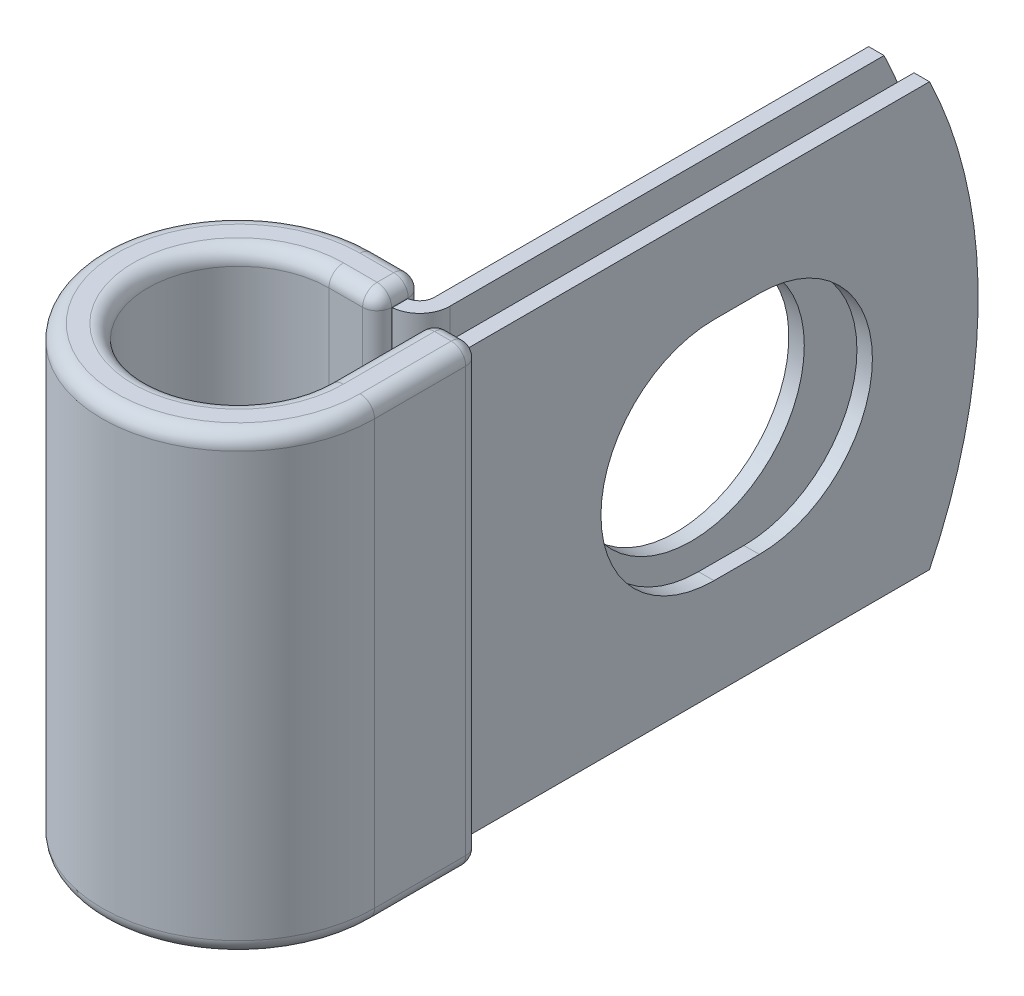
ISO-10303-21;
HEADER;
FILE_DESCRIPTION(('STEP AP214'),'2;1');
FILE_NAME('part.step','',(''),(''),'','','');
FILE_SCHEMA(('AUTOMOTIVE_DESIGN { 1 0 10303 214 1 1 1 1 }'));
ENDSEC;
DATA;
#1=APPLICATION_CONTEXT('core data for automotive mechanical design processes');
#2=APPLICATION_PROTOCOL_DEFINITION('international standard','automotive_design',2000,#1);
#3=PRODUCT_CONTEXT('',#1,'mechanical');
#4=PRODUCT('Part','Part','',(#3));
#5=PRODUCT_RELATED_PRODUCT_CATEGORY('part','',(#4));
#6=PRODUCT_DEFINITION_FORMATION('','',#4);
#7=PRODUCT_DEFINITION_CONTEXT('part definition',#1,'design');
#8=PRODUCT_DEFINITION('design','',#6,#7);
#9=PRODUCT_DEFINITION_SHAPE('','',#8);
#10=(LENGTH_UNIT() NAMED_UNIT(*) SI_UNIT(.MILLI.,.METRE.));
#11=(NAMED_UNIT(*) PLANE_ANGLE_UNIT() SI_UNIT($,.RADIAN.));
#12=(NAMED_UNIT(*) SI_UNIT($,.STERADIAN.) SOLID_ANGLE_UNIT());
#13=UNCERTAINTY_MEASURE_WITH_UNIT(LENGTH_MEASURE(1.E-05),#10,'distance_accuracy_value','');
#14=(GEOMETRIC_REPRESENTATION_CONTEXT(3) GLOBAL_UNCERTAINTY_ASSIGNED_CONTEXT((#13)) GLOBAL_UNIT_ASSIGNED_CONTEXT((#10,
#11,#12)) REPRESENTATION_CONTEXT('',''));
#15=CARTESIAN_POINT('',(0.,0.,0.));
#16=DIRECTION('',(0.,0.,1.));
#17=DIRECTION('',(1.,0.,0.));
#18=AXIS2_PLACEMENT_3D('',#15,#16,#17);
#19=CARTESIAN_POINT('',(3.98145,11.1125,-32.5374));
#20=DIRECTION('',(1.,0.,0.));
#21=DIRECTION('',(0.,0.,-1.));
#22=AXIS2_PLACEMENT_3D('',#19,#20,#21);
#23=PLANE('',#22);
#24=CARTESIAN_POINT('',(3.98145,0.,-19.8374));
#25=DIRECTION('',(1.,0.,0.));
#26=DIRECTION('',(0.,0.,-1.));
#27=AXIS2_PLACEMENT_3D('',#24,#25,#26);
#28=CIRCLE('',#27,5.9436);
#29=CARTESIAN_POINT('',(3.98145,0.,-25.781));
#30=VERTEX_POINT('',#29);
#31=EDGE_CURVE('E454',#30,#30,#28,.F.);
#32=ORIENTED_EDGE('',*,*,#31,.T.);
#33=EDGE_LOOP('',(#32));
#34=FACE_BOUND('',#33,.T.);
#35=DIRECTION('',(0.,0.,1.));
#36=VECTOR('',#35,1.);
#37=CARTESIAN_POINT('',(3.98145,-11.1125,-32.5374));
#38=LINE('',#37,#36);
#39=CARTESIAN_POINT('',(3.98145,-11.1125,-29.9775476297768));
#40=VERTEX_POINT('',#39);
#41=CARTESIAN_POINT('',(3.98145,-11.1125,-7.14121));
#42=VERTEX_POINT('',#41);
#43=EDGE_CURVE('E478',#40,#42,#38,.T.);
#44=ORIENTED_EDGE('',*,*,#43,.F.);
#45=CARTESIAN_POINT('',(3.98145,0.,-7.1374));
#46=DIRECTION('',(1.,0.,0.));
#47=DIRECTION('',(0.,0.,-1.));
#48=AXIS2_PLACEMENT_3D('',#45,#46,#47);
#49=CIRCLE('',#48,25.4);
#50=CARTESIAN_POINT('',(3.98145,11.1125,-29.9775476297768));
#51=VERTEX_POINT('',#50);
#52=EDGE_CURVE('E413',#40,#51,#49,.T.);
#53=ORIENTED_EDGE('',*,*,#52,.T.);
#54=DIRECTION('',(0.,0.,1.));
#55=VECTOR('',#54,1.);
#56=CARTESIAN_POINT('',(3.98145,11.1125,-32.5374));
#57=LINE('',#56,#55);
#58=CARTESIAN_POINT('',(3.98145,11.1125,-7.14121));
#59=VERTEX_POINT('',#58);
#60=EDGE_CURVE('E466',#51,#59,#57,.T.);
#61=ORIENTED_EDGE('',*,*,#60,.T.);
#62=DIRECTION('',(0.,-1.,0.));
#63=VECTOR('',#62,1.);
#64=CARTESIAN_POINT('',(3.98145,11.1125,-7.14121));
#65=LINE('',#64,#63);
#66=EDGE_CURVE('E488',#59,#42,#65,.T.);
#67=ORIENTED_EDGE('',*,*,#66,.T.);
#68=EDGE_LOOP('',(#44,#53,#61,#67));
#69=FACE_BOUND('',#68,.T.);
#70=ADVANCED_FACE('F54',(#34,#69),#23,.T.);
#71=CARTESIAN_POINT('',(3.16865,11.1125,-32.5374));
#72=DIRECTION('',(1.,0.,0.));
#73=DIRECTION('',(0.,0.,-1.));
#74=AXIS2_PLACEMENT_3D('',#71,#72,#73);
#75=PLANE('',#74);
#76=CARTESIAN_POINT('',(3.16865,0.,-19.8374));
#77=DIRECTION('',(-1.,0.,0.));
#78=DIRECTION('',(0.,0.,1.));
#79=AXIS2_PLACEMENT_3D('',#76,#77,#78);
#80=CIRCLE('',#79,5.9436);
#81=CARTESIAN_POINT('',(3.16865,0.,-13.8938));
#82=VERTEX_POINT('',#81);
#83=EDGE_CURVE('E451',#82,#82,#80,.T.);
#84=ORIENTED_EDGE('',*,*,#83,.F.);
#85=EDGE_LOOP('',(#84));
#86=FACE_BOUND('',#85,.T.);
#87=CARTESIAN_POINT('',(3.16865,0.,-7.1374));
#88=DIRECTION('',(-1.,0.,0.));
#89=DIRECTION('',(0.,0.,1.));
#90=AXIS2_PLACEMENT_3D('',#87,#88,#89);
#91=CIRCLE('',#90,25.4);
#92=CARTESIAN_POINT('',(3.16865,11.1125,-29.9775476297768));
#93=VERTEX_POINT('',#92);
#94=CARTESIAN_POINT('',(3.16865,-11.1125,-29.9775476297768));
#95=VERTEX_POINT('',#94);
#96=EDGE_CURVE('E405',#93,#95,#91,.T.);
#97=ORIENTED_EDGE('',*,*,#96,.T.);
#98=DIRECTION('',(0.,0.,1.));
#99=VECTOR('',#98,1.);
#100=CARTESIAN_POINT('',(3.16865,-11.1125,-32.5374));
#101=LINE('',#100,#99);
#102=CARTESIAN_POINT('',(3.16865,-11.1125,-7.14121));
#103=VERTEX_POINT('',#102);
#104=EDGE_CURVE('E480',#95,#103,#101,.T.);
#105=ORIENTED_EDGE('',*,*,#104,.T.);
#106=DIRECTION('',(0.,-1.,0.));
#107=VECTOR('',#106,1.);
#108=CARTESIAN_POINT('',(3.16865,11.1125,-7.14121));
#109=LINE('',#108,#107);
#110=CARTESIAN_POINT('',(3.16865,11.1125,-7.14121));
#111=VERTEX_POINT('',#110);
#112=EDGE_CURVE('E473',#111,#103,#109,.T.);
#113=ORIENTED_EDGE('',*,*,#112,.F.);
#114=DIRECTION('',(0.,0.,1.));
#115=VECTOR('',#114,1.);
#116=CARTESIAN_POINT('',(3.16865,11.1125,-32.5374));
#117=LINE('',#116,#115);
#118=EDGE_CURVE('E468',#93,#111,#117,.T.);
#119=ORIENTED_EDGE('',*,*,#118,.F.);
#120=EDGE_LOOP('',(#97,#105,#113,#119));
#121=FACE_BOUND('',#120,.T.);
#122=ADVANCED_FACE('F771',(#86,#121),#75,.F.);
#123=CARTESIAN_POINT('',(0.,-11.1125,0.));
#124=DIRECTION('',(0.,1.,0.));
#125=DIRECTION('',(1.,0.,0.));
#126=AXIS2_PLACEMENT_3D('',#123,#124,#125);
#127=PLANE('',#126);
#128=CARTESIAN_POINT('',(2.39649,-11.1125,-7.14121));
#129=DIRECTION('',(0.,-1.,0.));
#130=DIRECTION('',(0.,0.,1.));
#131=AXIS2_PLACEMENT_3D('',#128,#129,#130);
#132=CIRCLE('',#131,1.58496);
#133=CARTESIAN_POINT('',(2.53365000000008,-11.1125,-5.56219596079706));
#134=VERTEX_POINT('',#133);
#135=EDGE_CURVE('E475',#42,#134,#132,.T.);
#136=ORIENTED_EDGE('',*,*,#135,.T.);
#137=DIRECTION('',(0.,0.,-1.));
#138=VECTOR('',#137,1.);
#139=CARTESIAN_POINT('',(2.53365000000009,-11.1125,-6.36905));
#140=LINE('',#139,#138);
#141=CARTESIAN_POINT('',(2.53365000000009,-11.1125,-6.38132961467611));
#142=VERTEX_POINT('',#141);
#143=EDGE_CURVE('E363',#134,#142,#140,.T.);
#144=ORIENTED_EDGE('',*,*,#143,.T.);
#145=CARTESIAN_POINT('',(2.39649,-11.1125,-7.14121));
#146=DIRECTION('',(0.,1.,0.));
#147=DIRECTION('',(1.,0.,0.));
#148=AXIS2_PLACEMENT_3D('',#145,#146,#147);
#149=CIRCLE('',#148,0.77216);
#150=EDGE_CURVE('E482',#103,#142,#149,.F.);
#151=ORIENTED_EDGE('',*,*,#150,.F.);
#152=ORIENTED_EDGE('',*,*,#104,.F.);
#153=DIRECTION('',(-1.,0.,0.));
#154=VECTOR('',#153,1.);
#155=CARTESIAN_POINT('',(6.36905,-11.1125,-29.9775476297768));
#156=LINE('',#155,#154);
#157=EDGE_CURVE('E497',#40,#95,#156,.T.);
#158=ORIENTED_EDGE('',*,*,#157,.F.);
#159=ORIENTED_EDGE('',*,*,#43,.T.);
#160=EDGE_LOOP('',(#136,#144,#151,#152,#158,#159));
#161=FACE_BOUND('',#160,.T.);
#162=ADVANCED_FACE('F777',(#161),#127,.F.);
#163=CARTESIAN_POINT('',(0.,11.1125,0.));
#164=DIRECTION('',(0.,1.,0.));
#165=DIRECTION('',(1.,0.,0.));
#166=AXIS2_PLACEMENT_3D('',#163,#164,#165);
#167=PLANE('',#166);
#168=DIRECTION('',(0.,0.,-1.));
#169=VECTOR('',#168,1.);
#170=CARTESIAN_POINT('',(2.53365,11.1125,0.));
#171=LINE('',#170,#169);
#172=CARTESIAN_POINT('',(2.53365000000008,11.1125,-5.56219596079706));
#173=VERTEX_POINT('',#172);
#174=CARTESIAN_POINT('',(2.53365000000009,11.1125,-6.38132961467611));
#175=VERTEX_POINT('',#174);
#176=EDGE_CURVE('E400',#173,#175,#171,.T.);
#177=ORIENTED_EDGE('',*,*,#176,.F.);
#178=CARTESIAN_POINT('',(2.39649,11.1125,-7.14121));
#179=DIRECTION('',(0.,-1.,0.));
#180=DIRECTION('',(0.,0.,1.));
#181=AXIS2_PLACEMENT_3D('',#178,#179,#180);
#182=CIRCLE('',#181,1.58496);
#183=EDGE_CURVE('E463',#59,#173,#182,.T.);
#184=ORIENTED_EDGE('',*,*,#183,.F.);
#185=ORIENTED_EDGE('',*,*,#60,.F.);
#186=DIRECTION('',(-1.,0.,0.));
#187=VECTOR('',#186,1.);
#188=CARTESIAN_POINT('',(6.36905,11.1125,-29.9775476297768));
#189=LINE('',#188,#187);
#190=EDGE_CURVE('E494',#51,#93,#189,.T.);
#191=ORIENTED_EDGE('',*,*,#190,.T.);
#192=ORIENTED_EDGE('',*,*,#118,.T.);
#193=CARTESIAN_POINT('',(2.39649,11.1125,-7.14121));
#194=DIRECTION('',(0.,1.,0.));
#195=DIRECTION('',(1.,0.,0.));
#196=AXIS2_PLACEMENT_3D('',#193,#194,#195);
#197=CIRCLE('',#196,0.77216);
#198=EDGE_CURVE('E470',#111,#175,#197,.F.);
#199=ORIENTED_EDGE('',*,*,#198,.T.);
#200=EDGE_LOOP('',(#177,#184,#185,#191,#192,#199));
#201=FACE_BOUND('',#200,.T.);
#202=ADVANCED_FACE('F785',(#201),#167,.T.);
#203=CARTESIAN_POINT('',(2.39649,11.1125,-7.14121));
#204=DIRECTION('',(0.,-1.,0.));
#205=DIRECTION('',(0.,0.,-1.));
#206=AXIS2_PLACEMENT_3D('',#203,#204,#205);
#207=CYLINDRICAL_SURFACE('',#206,1.58496);
#208=ORIENTED_EDGE('',*,*,#135,.F.);
#209=ORIENTED_EDGE('',*,*,#66,.F.);
#210=ORIENTED_EDGE('',*,*,#183,.T.);
#211=CARTESIAN_POINT('',(2.39649,11.1125,-7.14121));
#212=DIRECTION('',(0.,-1.,0.));
#213=DIRECTION('',(0.,0.,-1.));
#214=AXIS2_PLACEMENT_3D('',#211,#212,#213);
#215=CIRCLE('',#214,1.58496);
#216=CARTESIAN_POINT('',(2.39649,11.1125,-5.55625));
#217=VERTEX_POINT('',#216);
#218=EDGE_CURVE('E397',#217,#173,#215,.F.);
#219=ORIENTED_EDGE('',*,*,#218,.F.);
#220=DIRECTION('',(0.,-1.,0.));
#221=VECTOR('',#220,1.);
#222=CARTESIAN_POINT('',(2.39649,11.1125,-5.55625));
#223=LINE('',#222,#221);
#224=CARTESIAN_POINT('',(2.39649,-11.1125,-5.55625));
#225=VERTEX_POINT('',#224);
#226=EDGE_CURVE('E491',#217,#225,#223,.T.);
#227=ORIENTED_EDGE('',*,*,#226,.T.);
#228=CARTESIAN_POINT('',(2.39649,-11.1125,-7.14121));
#229=DIRECTION('',(0.,1.,0.));
#230=DIRECTION('',(-1.,0.,0.));
#231=AXIS2_PLACEMENT_3D('',#228,#229,#230);
#232=CIRCLE('',#231,1.58496);
#233=EDGE_CURVE('E395',#134,#225,#232,.F.);
#234=ORIENTED_EDGE('',*,*,#233,.F.);
#235=EDGE_LOOP('',(#208,#209,#210,#219,#227,#234));
#236=FACE_BOUND('',#235,.T.);
#237=ADVANCED_FACE('F782',(#236),#207,.T.);
#238=CARTESIAN_POINT('',(2.39649,11.1125,-7.14121));
#239=DIRECTION('',(0.,-1.,0.));
#240=DIRECTION('',(0.,0.,-1.));
#241=AXIS2_PLACEMENT_3D('',#238,#239,#240);
#242=CYLINDRICAL_SURFACE('',#241,0.77216);
#243=ORIENTED_EDGE('',*,*,#150,.T.);
#244=DIRECTION('',(0.,-1.,0.));
#245=VECTOR('',#244,1.);
#246=CARTESIAN_POINT('',(2.53365000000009,11.1125,-6.38132961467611));
#247=LINE('',#246,#245);
#248=EDGE_CURVE('E500',#142,#175,#247,.F.);
#249=ORIENTED_EDGE('',*,*,#248,.T.);
#250=ORIENTED_EDGE('',*,*,#198,.F.);
#251=ORIENTED_EDGE('',*,*,#112,.T.);
#252=EDGE_LOOP('',(#243,#249,#250,#251));
#253=FACE_BOUND('',#252,.T.);
#254=ADVANCED_FACE('F784',(#253),#242,.F.);
#255=CARTESIAN_POINT('',(20.7924894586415,0.,-19.8374));
#256=DIRECTION('',(-1.,0.,0.));
#257=DIRECTION('',(0.,0.,1.));
#258=AXIS2_PLACEMENT_3D('',#255,#256,#257);
#259=CYLINDRICAL_SURFACE('',#258,5.9436);
#260=ORIENTED_EDGE('',*,*,#83,.T.);
#261=EDGE_LOOP('',(#260));
#262=FACE_BOUND('',#261,.T.);
#263=ORIENTED_EDGE('',*,*,#31,.F.);
#264=EDGE_LOOP('',(#263));
#265=FACE_BOUND('',#264,.T.);
#266=ADVANCED_FACE('F791',(#262,#265),#259,.F.);
#267=CARTESIAN_POINT('',(6.36905,0.,-7.1374));
#268=DIRECTION('',(-1.,0.,0.));
#269=DIRECTION('',(0.,0.,1.));
#270=AXIS2_PLACEMENT_3D('',#267,#268,#269);
#271=CYLINDRICAL_SURFACE('',#270,25.4);
#272=ORIENTED_EDGE('',*,*,#52,.F.);
#273=ORIENTED_EDGE('',*,*,#157,.T.);
#274=ORIENTED_EDGE('',*,*,#96,.F.);
#275=ORIENTED_EDGE('',*,*,#190,.F.);
#276=EDGE_LOOP('',(#272,#273,#274,#275));
#277=FACE_BOUND('',#276,.T.);
#278=ADVANCED_FACE('F844',(#277),#271,.T.);
#279=CARTESIAN_POINT('',(0.,-11.1125,-5.55625));
#280=DIRECTION('',(0.,0.,1.));
#281=DIRECTION('',(1.,0.,0.));
#282=AXIS2_PLACEMENT_3D('',#279,#280,#281);
#283=PLANE('',#282);
#284=DIRECTION('',(1.,0.,0.));
#285=VECTOR('',#284,1.);
#286=CARTESIAN_POINT('',(0.,-11.1125,-5.55625));
#287=LINE('',#286,#285);
#288=CARTESIAN_POINT('',(2.53365000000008,-11.1125,-5.55625));
#289=VERTEX_POINT('',#288);
#290=EDGE_CURVE('E370',#225,#289,#287,.T.);
#291=ORIENTED_EDGE('',*,*,#290,.F.);
#292=ORIENTED_EDGE('',*,*,#226,.F.);
#293=DIRECTION('',(1.,0.,0.));
#294=VECTOR('',#293,1.);
#295=CARTESIAN_POINT('',(0.,11.1125,-5.55625));
#296=LINE('',#295,#294);
#297=CARTESIAN_POINT('',(2.53365000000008,11.1125,-5.55625));
#298=VERTEX_POINT('',#297);
#299=EDGE_CURVE('E372',#217,#298,#296,.T.);
#300=ORIENTED_EDGE('',*,*,#299,.T.);
#301=DIRECTION('',(0.,-1.,0.));
#302=VECTOR('',#301,1.);
#303=CARTESIAN_POINT('',(2.53365000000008,-11.1125,-5.55625));
#304=LINE('',#303,#302);
#305=EDGE_CURVE('E302',#298,#289,#304,.T.);
#306=ORIENTED_EDGE('',*,*,#305,.T.);
#307=EDGE_LOOP('',(#291,#292,#300,#306));
#308=FACE_BOUND('',#307,.T.);
#309=ADVANCED_FACE('F816',(#308),#283,.F.);
#310=CARTESIAN_POINT('',(2.53365000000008,-11.14425,-5.5245));
#311=DIRECTION('',(1.,0.,0.));
#312=DIRECTION('',(0.,0.,-1.));
#313=AXIS2_PLACEMENT_3D('',#310,#311,#312);
#314=PLANE('',#313);
#315=DIRECTION('',(0.,0.,-1.));
#316=VECTOR('',#315,1.);
#317=CARTESIAN_POINT('',(2.53365000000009,-11.14425,-6.4008));
#318=LINE('',#317,#316);
#319=CARTESIAN_POINT('',(2.53365000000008,-11.14425,-5.52449999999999));
#320=VERTEX_POINT('',#319);
#321=CARTESIAN_POINT('',(2.53365000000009,-11.14425,-6.40079999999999));
#322=VERTEX_POINT('',#321);
#323=EDGE_CURVE('E510',#320,#322,#318,.T.);
#324=ORIENTED_EDGE('',*,*,#323,.T.);
#325=DIRECTION('',(0.,1.,0.));
#326=VECTOR('',#325,1.);
#327=CARTESIAN_POINT('',(2.53365000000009,-11.14425,-6.40079999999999));
#328=LINE('',#327,#326);
#329=CARTESIAN_POINT('',(2.53365000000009,11.14425,-6.40079999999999));
#330=VERTEX_POINT('',#329);
#331=EDGE_CURVE('E512',#322,#330,#328,.T.);
#332=ORIENTED_EDGE('',*,*,#331,.T.);
#333=DIRECTION('',(0.,0.,1.));
#334=VECTOR('',#333,1.);
#335=CARTESIAN_POINT('',(2.53365000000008,11.14425,-5.5245));
#336=LINE('',#335,#334);
#337=CARTESIAN_POINT('',(2.53365000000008,11.14425,-5.52449999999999));
#338=VERTEX_POINT('',#337);
#339=EDGE_CURVE('E506',#330,#338,#336,.T.);
#340=ORIENTED_EDGE('',*,*,#339,.T.);
#341=DIRECTION('',(0.,-1.,0.));
#342=VECTOR('',#341,1.);
#343=CARTESIAN_POINT('',(2.53365000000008,-11.14425,-5.52449999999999));
#344=LINE('',#343,#342);
#345=EDGE_CURVE('E508',#338,#320,#344,.T.);
#346=ORIENTED_EDGE('',*,*,#345,.T.);
#347=EDGE_LOOP('',(#324,#332,#340,#346));
#348=FACE_BOUND('',#347,.T.);
#349=ORIENTED_EDGE('',*,*,#248,.F.);
#350=ORIENTED_EDGE('',*,*,#143,.F.);
#351=EDGE_CURVE('E364',#289,#134,#140,.T.);
#352=ORIENTED_EDGE('',*,*,#351,.F.);
#353=ORIENTED_EDGE('',*,*,#305,.F.);
#354=DIRECTION('',(0.,0.,1.));
#355=VECTOR('',#354,1.);
#356=CARTESIAN_POINT('',(2.53365000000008,11.1125,-5.55625));
#357=LINE('',#356,#355);
#358=EDGE_CURVE('E367',#173,#298,#357,.T.);
#359=ORIENTED_EDGE('',*,*,#358,.F.);
#360=ORIENTED_EDGE('',*,*,#176,.T.);
#361=EDGE_LOOP('',(#349,#350,#352,#353,#359,#360));
#362=FACE_BOUND('',#361,.T.);
#363=ADVANCED_FACE('F682',(#348,#362),#314,.T.);
#364=CARTESIAN_POINT('',(0.,-11.14425,-6.4008));
#365=DIRECTION('',(1.,0.,0.));
#366=DIRECTION('',(0.,0.,-1.));
#367=AXIS2_PLACEMENT_3D('',#364,#365,#366);
#368=CYLINDRICAL_SURFACE('',#367,0.761999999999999);
#369=DIRECTION('',(1.,0.,0.));
#370=VECTOR('',#369,1.);
#371=CARTESIAN_POINT('',(0.,-11.14425,-7.1628));
#372=LINE('',#371,#370);
#373=CARTESIAN_POINT('',(0.,-11.14425,-7.1628));
#374=VERTEX_POINT('',#373);
#375=CARTESIAN_POINT('',(1.77165000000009,-11.14425,-7.1628));
#376=VERTEX_POINT('',#375);
#377=EDGE_CURVE('E389',#374,#376,#372,.T.);
#378=ORIENTED_EDGE('',*,*,#377,.T.);
#379=CARTESIAN_POINT('',(1.77165000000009,-11.14425,-6.4008));
#380=DIRECTION('',(1.,0.,0.));
#381=DIRECTION('',(0.,0.,-1.));
#382=AXIS2_PLACEMENT_3D('',#379,#380,#381);
#383=CIRCLE('',#382,0.761999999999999);
#384=CARTESIAN_POINT('',(1.77165000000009,-11.90625,-6.4008));
#385=VERTEX_POINT('',#384);
#386=EDGE_CURVE('E517',#376,#385,#383,.F.);
#387=ORIENTED_EDGE('',*,*,#386,.T.);
#388=DIRECTION('',(1.,0.,0.));
#389=VECTOR('',#388,1.);
#390=CARTESIAN_POINT('',(0.,-11.90625,-6.4008));
#391=LINE('',#390,#389);
#392=CARTESIAN_POINT('',(0.,-11.90625,-6.4008));
#393=VERTEX_POINT('',#392);
#394=EDGE_CURVE('E392',#393,#385,#391,.T.);
#395=ORIENTED_EDGE('',*,*,#394,.F.);
#396=CARTESIAN_POINT('',(0.,-11.14425,-6.4008));
#397=DIRECTION('',(1.,0.,0.));
#398=DIRECTION('',(0.,0.,1.));
#399=AXIS2_PLACEMENT_3D('',#396,#397,#398);
#400=CIRCLE('',#399,0.761999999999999);
#401=EDGE_CURVE('E340',#393,#374,#400,.T.);
#402=ORIENTED_EDGE('',*,*,#401,.T.);
#403=EDGE_LOOP('',(#378,#387,#395,#402));
#404=FACE_BOUND('',#403,.T.);
#405=ADVANCED_FACE('F657',(#404),#368,.T.);
#406=CARTESIAN_POINT('',(0.,11.14425,-7.1628));
#407=DIRECTION('',(0.,0.,-1.));
#408=DIRECTION('',(-1.,0.,0.));
#409=AXIS2_PLACEMENT_3D('',#406,#407,#408);
#410=PLANE('',#409);
#411=DIRECTION('',(1.,0.,0.));
#412=VECTOR('',#411,1.);
#413=CARTESIAN_POINT('',(0.,11.14425,-7.1628));
#414=LINE('',#413,#412);
#415=CARTESIAN_POINT('',(0.,11.14425,-7.1628));
#416=VERTEX_POINT('',#415);
#417=CARTESIAN_POINT('',(1.77165000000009,11.14425,-7.1628));
#418=VERTEX_POINT('',#417);
#419=EDGE_CURVE('E386',#416,#418,#414,.T.);
#420=ORIENTED_EDGE('',*,*,#419,.T.);
#421=DIRECTION('',(0.,1.,0.));
#422=VECTOR('',#421,1.);
#423=CARTESIAN_POINT('',(1.77165000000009,11.14425,-7.1628));
#424=LINE('',#423,#422);
#425=EDGE_CURVE('E515',#418,#376,#424,.F.);
#426=ORIENTED_EDGE('',*,*,#425,.T.);
#427=ORIENTED_EDGE('',*,*,#377,.F.);
#428=DIRECTION('',(0.,1.,0.));
#429=VECTOR('',#428,1.);
#430=CARTESIAN_POINT('',(0.,11.14425,-7.1628));
#431=LINE('',#430,#429);
#432=EDGE_CURVE('E337',#374,#416,#431,.T.);
#433=ORIENTED_EDGE('',*,*,#432,.T.);
#434=EDGE_LOOP('',(#420,#426,#427,#433));
#435=FACE_BOUND('',#434,.T.);
#436=ADVANCED_FACE('F663',(#435),#410,.T.);
#437=CARTESIAN_POINT('',(0.,11.14425,-6.4008));
#438=DIRECTION('',(1.,0.,0.));
#439=DIRECTION('',(0.,0.,-1.));
#440=AXIS2_PLACEMENT_3D('',#437,#438,#439);
#441=CYLINDRICAL_SURFACE('',#440,0.762000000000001);
#442=DIRECTION('',(1.,0.,0.));
#443=VECTOR('',#442,1.);
#444=CARTESIAN_POINT('',(0.,11.90625,-6.4008));
#445=LINE('',#444,#443);
#446=CARTESIAN_POINT('',(0.,11.90625,-6.4008));
#447=VERTEX_POINT('',#446);
#448=CARTESIAN_POINT('',(1.77165000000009,11.90625,-6.4008));
#449=VERTEX_POINT('',#448);
#450=EDGE_CURVE('E383',#447,#449,#445,.T.);
#451=ORIENTED_EDGE('',*,*,#450,.T.);
#452=CARTESIAN_POINT('',(1.77165000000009,11.14425,-6.4008));
#453=DIRECTION('',(1.,0.,0.));
#454=DIRECTION('',(0.,0.,-1.));
#455=AXIS2_PLACEMENT_3D('',#452,#453,#454);
#456=CIRCLE('',#455,0.762000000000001);
#457=EDGE_CURVE('E503',#449,#418,#456,.F.);
#458=ORIENTED_EDGE('',*,*,#457,.T.);
#459=ORIENTED_EDGE('',*,*,#419,.F.);
#460=CARTESIAN_POINT('',(0.,11.14425,-6.4008));
#461=DIRECTION('',(1.,0.,0.));
#462=DIRECTION('',(0.,0.,1.));
#463=AXIS2_PLACEMENT_3D('',#460,#461,#462);
#464=CIRCLE('',#463,0.762000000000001);
#465=EDGE_CURVE('E334',#416,#447,#464,.T.);
#466=ORIENTED_EDGE('',*,*,#465,.T.);
#467=EDGE_LOOP('',(#451,#458,#459,#466));
#468=FACE_BOUND('',#467,.T.);
#469=ADVANCED_FACE('F667',(#468),#441,.T.);
#470=CARTESIAN_POINT('',(0.,11.14425,-5.5245));
#471=DIRECTION('',(1.,0.,0.));
#472=DIRECTION('',(0.,0.,-1.));
#473=AXIS2_PLACEMENT_3D('',#470,#471,#472);
#474=CYLINDRICAL_SURFACE('',#473,0.762);
#475=DIRECTION('',(1.,0.,0.));
#476=VECTOR('',#475,1.);
#477=CARTESIAN_POINT('',(0.,11.14425,-4.7625));
#478=LINE('',#477,#476);
#479=CARTESIAN_POINT('',(0.,11.14425,-4.7625));
#480=VERTEX_POINT('',#479);
#481=CARTESIAN_POINT('',(1.77165000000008,11.14425,-4.7625));
#482=VERTEX_POINT('',#481);
#483=EDGE_CURVE('E377',#480,#482,#478,.T.);
#484=ORIENTED_EDGE('',*,*,#483,.T.);
#485=CARTESIAN_POINT('',(1.77165000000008,11.14425,-5.5245));
#486=DIRECTION('',(1.,0.,0.));
#487=DIRECTION('',(0.,0.,-1.));
#488=AXIS2_PLACEMENT_3D('',#485,#486,#487);
#489=CIRCLE('',#488,0.762);
#490=CARTESIAN_POINT('',(1.77165000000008,11.90625,-5.5245));
#491=VERTEX_POINT('',#490);
#492=EDGE_CURVE('E527',#482,#491,#489,.F.);
#493=ORIENTED_EDGE('',*,*,#492,.T.);
#494=DIRECTION('',(1.,0.,0.));
#495=VECTOR('',#494,1.);
#496=CARTESIAN_POINT('',(0.,11.90625,-5.5245));
#497=LINE('',#496,#495);
#498=CARTESIAN_POINT('',(0.,11.90625,-5.5245));
#499=VERTEX_POINT('',#498);
#500=EDGE_CURVE('E380',#499,#491,#497,.T.);
#501=ORIENTED_EDGE('',*,*,#500,.F.);
#502=CARTESIAN_POINT('',(0.,11.14425,-5.5245));
#503=DIRECTION('',(1.,0.,0.));
#504=DIRECTION('',(0.,0.,1.));
#505=AXIS2_PLACEMENT_3D('',#502,#503,#504);
#506=CIRCLE('',#505,0.762);
#507=EDGE_CURVE('E331',#499,#480,#506,.T.);
#508=ORIENTED_EDGE('',*,*,#507,.T.);
#509=EDGE_LOOP('',(#484,#493,#501,#508));
#510=FACE_BOUND('',#509,.T.);
#511=ADVANCED_FACE('F708',(#510),#474,.T.);
#512=CARTESIAN_POINT('',(0.,-11.14425,-4.7625));
#513=DIRECTION('',(0.,0.,1.));
#514=DIRECTION('',(1.,0.,0.));
#515=AXIS2_PLACEMENT_3D('',#512,#513,#514);
#516=PLANE('',#515);
#517=DIRECTION('',(1.,0.,0.));
#518=VECTOR('',#517,1.);
#519=CARTESIAN_POINT('',(0.,-11.14425,-4.7625));
#520=LINE('',#519,#518);
#521=CARTESIAN_POINT('',(0.,-11.14425,-4.7625));
#522=VERTEX_POINT('',#521);
#523=CARTESIAN_POINT('',(1.77165000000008,-11.14425,-4.7625));
#524=VERTEX_POINT('',#523);
#525=EDGE_CURVE('E374',#522,#524,#520,.T.);
#526=ORIENTED_EDGE('',*,*,#525,.T.);
#527=DIRECTION('',(0.,-1.,0.));
#528=VECTOR('',#527,1.);
#529=CARTESIAN_POINT('',(1.77165000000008,-11.14425,-4.7625));
#530=LINE('',#529,#528);
#531=EDGE_CURVE('E525',#524,#482,#530,.F.);
#532=ORIENTED_EDGE('',*,*,#531,.T.);
#533=ORIENTED_EDGE('',*,*,#483,.F.);
#534=DIRECTION('',(0.,-1.,0.));
#535=VECTOR('',#534,1.);
#536=CARTESIAN_POINT('',(0.,-11.14425,-4.7625));
#537=LINE('',#536,#535);
#538=EDGE_CURVE('E322',#480,#522,#537,.T.);
#539=ORIENTED_EDGE('',*,*,#538,.T.);
#540=EDGE_LOOP('',(#526,#532,#533,#539));
#541=FACE_BOUND('',#540,.T.);
#542=ADVANCED_FACE('F706',(#541),#516,.T.);
#543=CARTESIAN_POINT('',(0.,-11.14425,-5.5245));
#544=DIRECTION('',(1.,0.,0.));
#545=DIRECTION('',(0.,0.,-1.));
#546=AXIS2_PLACEMENT_3D('',#543,#544,#545);
#547=CYLINDRICAL_SURFACE('',#546,0.761999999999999);
#548=DIRECTION('',(1.,0.,0.));
#549=VECTOR('',#548,1.);
#550=CARTESIAN_POINT('',(0.,-11.90625,-5.5245));
#551=LINE('',#550,#549);
#552=CARTESIAN_POINT('',(0.,-11.90625,-5.5245));
#553=VERTEX_POINT('',#552);
#554=CARTESIAN_POINT('',(1.77165000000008,-11.90625,-5.5245));
#555=VERTEX_POINT('',#554);
#556=EDGE_CURVE('E298',#553,#555,#551,.T.);
#557=ORIENTED_EDGE('',*,*,#556,.T.);
#558=CARTESIAN_POINT('',(1.77165000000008,-11.14425,-5.5245));
#559=DIRECTION('',(1.,0.,0.));
#560=DIRECTION('',(0.,0.,-1.));
#561=AXIS2_PLACEMENT_3D('',#558,#559,#560);
#562=CIRCLE('',#561,0.761999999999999);
#563=EDGE_CURVE('E523',#555,#524,#562,.F.);
#564=ORIENTED_EDGE('',*,*,#563,.T.);
#565=ORIENTED_EDGE('',*,*,#525,.F.);
#566=CARTESIAN_POINT('',(0.,-11.14425,-5.5245));
#567=DIRECTION('',(1.,0.,0.));
#568=DIRECTION('',(0.,0.,-1.));
#569=AXIS2_PLACEMENT_3D('',#566,#567,#568);
#570=CIRCLE('',#569,0.761999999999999);
#571=EDGE_CURVE('E319',#522,#553,#570,.T.);
#572=ORIENTED_EDGE('',*,*,#571,.T.);
#573=EDGE_LOOP('',(#557,#564,#565,#572));
#574=FACE_BOUND('',#573,.T.);
#575=ADVANCED_FACE('F696',(#574),#547,.T.);
#576=CARTESIAN_POINT('',(0.,-11.14425,0.));
#577=DIRECTION('',(0.,-1.,0.));
#578=DIRECTION('',(0.,0.,-1.));
#579=AXIS2_PLACEMENT_3D('',#576,#577,#578);
#580=TOROIDAL_SURFACE('',#579,6.4008,0.761999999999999);
#581=CARTESIAN_POINT('',(6.4008,-11.14425,0.));
#582=DIRECTION('',(0.,0.,1.));
#583=DIRECTION('',(-1.,0.,0.));
#584=AXIS2_PLACEMENT_3D('',#581,#582,#583);
#585=CIRCLE('',#584,0.761999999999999);
#586=CARTESIAN_POINT('',(6.4008,-11.90625,0.));
#587=VERTEX_POINT('',#586);
#588=CARTESIAN_POINT('',(7.1628,-11.14425,0.));
#589=VERTEX_POINT('',#588);
#590=EDGE_CURVE('E313',#587,#589,#585,.T.);
#591=ORIENTED_EDGE('',*,*,#590,.T.);
#592=CARTESIAN_POINT('',(0.,-11.14425,0.));
#593=DIRECTION('',(0.,-1.,0.));
#594=DIRECTION('',(0.,0.,-1.));
#595=AXIS2_PLACEMENT_3D('',#592,#593,#594);
#596=CIRCLE('',#595,7.1628);
#597=EDGE_CURVE('E356',#589,#374,#596,.T.);
#598=ORIENTED_EDGE('',*,*,#597,.T.);
#599=ORIENTED_EDGE('',*,*,#401,.F.);
#600=CARTESIAN_POINT('',(0.,-11.90625,0.));
#601=DIRECTION('',(0.,-1.,0.));
#602=DIRECTION('',(0.,0.,-1.));
#603=AXIS2_PLACEMENT_3D('',#600,#601,#602);
#604=CIRCLE('',#603,6.4008);
#605=EDGE_CURVE('E303',#587,#393,#604,.T.);
#606=ORIENTED_EDGE('',*,*,#605,.F.);
#607=EDGE_LOOP('',(#591,#598,#599,#606));
#608=FACE_BOUND('',#607,.T.);
#609=ADVANCED_FACE('F654',(#608),#580,.T.);
#610=CARTESIAN_POINT('',(0.,11.1125,0.));
#611=DIRECTION('',(0.,-1.,0.));
#612=DIRECTION('',(0.,0.,-1.));
#613=AXIS2_PLACEMENT_3D('',#610,#611,#612);
#614=CYLINDRICAL_SURFACE('',#613,7.1628);
#615=DIRECTION('',(0.,1.,0.));
#616=VECTOR('',#615,1.);
#617=CARTESIAN_POINT('',(7.1628,11.14425,0.));
#618=LINE('',#617,#616);
#619=CARTESIAN_POINT('',(7.1628,11.14425,0.));
#620=VERTEX_POINT('',#619);
#621=EDGE_CURVE('E642',#589,#620,#618,.T.);
#622=ORIENTED_EDGE('',*,*,#621,.T.);
#623=CARTESIAN_POINT('',(0.,11.14425,0.));
#624=DIRECTION('',(0.,-1.,0.));
#625=DIRECTION('',(0.,0.,-1.));
#626=AXIS2_PLACEMENT_3D('',#623,#624,#625);
#627=CIRCLE('',#626,7.1628);
#628=EDGE_CURVE('E353',#620,#416,#627,.T.);
#629=ORIENTED_EDGE('',*,*,#628,.T.);
#630=ORIENTED_EDGE('',*,*,#432,.F.);
#631=ORIENTED_EDGE('',*,*,#597,.F.);
#632=EDGE_LOOP('',(#622,#629,#630,#631));
#633=FACE_BOUND('',#632,.T.);
#634=ADVANCED_FACE('F660',(#633),#614,.T.);
#635=CARTESIAN_POINT('',(0.,11.14425,0.));
#636=DIRECTION('',(0.,-1.,0.));
#637=DIRECTION('',(0.,0.,-1.));
#638=AXIS2_PLACEMENT_3D('',#635,#636,#637);
#639=TOROIDAL_SURFACE('',#638,6.4008,0.762000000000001);
#640=CARTESIAN_POINT('',(6.4008,11.14425,0.));
#641=DIRECTION('',(0.,0.,1.));
#642=DIRECTION('',(-1.,0.,0.));
#643=AXIS2_PLACEMENT_3D('',#640,#641,#642);
#644=CIRCLE('',#643,0.762000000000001);
#645=CARTESIAN_POINT('',(6.4008,11.90625,0.));
#646=VERTEX_POINT('',#645);
#647=EDGE_CURVE('E719',#620,#646,#644,.T.);
#648=ORIENTED_EDGE('',*,*,#647,.T.);
#649=CARTESIAN_POINT('',(0.,11.90625,0.));
#650=DIRECTION('',(0.,-1.,0.));
#651=DIRECTION('',(0.,0.,-1.));
#652=AXIS2_PLACEMENT_3D('',#649,#650,#651);
#653=CIRCLE('',#652,6.4008);
#654=EDGE_CURVE('E350',#646,#447,#653,.T.);
#655=ORIENTED_EDGE('',*,*,#654,.T.);
#656=ORIENTED_EDGE('',*,*,#465,.F.);
#657=ORIENTED_EDGE('',*,*,#628,.F.);
#658=EDGE_LOOP('',(#648,#655,#656,#657));
#659=FACE_BOUND('',#658,.T.);
#660=ADVANCED_FACE('F665',(#659),#639,.T.);
#661=CARTESIAN_POINT('',(0.,11.14425,0.));
#662=DIRECTION('',(0.,-1.,0.));
#663=DIRECTION('',(0.,0.,-1.));
#664=AXIS2_PLACEMENT_3D('',#661,#662,#663);
#665=TOROIDAL_SURFACE('',#664,5.5245,0.762);
#666=CARTESIAN_POINT('',(5.5245,11.14425,0.));
#667=DIRECTION('',(0.,0.,1.));
#668=DIRECTION('',(-1.,0.,0.));
#669=AXIS2_PLACEMENT_3D('',#666,#667,#668);
#670=CIRCLE('',#669,0.762);
#671=CARTESIAN_POINT('',(5.5245,11.90625,0.));
#672=VERTEX_POINT('',#671);
#673=CARTESIAN_POINT('',(4.7625,11.14425,0.));
#674=VERTEX_POINT('',#673);
#675=EDGE_CURVE('E717',#672,#674,#670,.T.);
#676=ORIENTED_EDGE('',*,*,#675,.T.);
#677=CARTESIAN_POINT('',(0.,11.14425,0.));
#678=DIRECTION('',(0.,-1.,0.));
#679=DIRECTION('',(0.,0.,-1.));
#680=AXIS2_PLACEMENT_3D('',#677,#678,#679);
#681=CIRCLE('',#680,4.7625);
#682=EDGE_CURVE('E344',#674,#480,#681,.T.);
#683=ORIENTED_EDGE('',*,*,#682,.T.);
#684=ORIENTED_EDGE('',*,*,#507,.F.);
#685=CARTESIAN_POINT('',(0.,11.90625,0.));
#686=DIRECTION('',(0.,-1.,0.));
#687=DIRECTION('',(0.,0.,-1.));
#688=AXIS2_PLACEMENT_3D('',#685,#686,#687);
#689=CIRCLE('',#688,5.5245);
#690=EDGE_CURVE('E347',#672,#499,#689,.T.);
#691=ORIENTED_EDGE('',*,*,#690,.F.);
#692=EDGE_LOOP('',(#676,#683,#684,#691));
#693=FACE_BOUND('',#692,.T.);
#694=ADVANCED_FACE('F715',(#693),#665,.T.);
#695=CARTESIAN_POINT('',(0.,11.1125,0.));
#696=DIRECTION('',(0.,-1.,0.));
#697=DIRECTION('',(0.,0.,-1.));
#698=AXIS2_PLACEMENT_3D('',#695,#696,#697);
#699=CYLINDRICAL_SURFACE('',#698,4.7625);
#700=DIRECTION('',(0.,-1.,0.));
#701=VECTOR('',#700,1.);
#702=CARTESIAN_POINT('',(4.7625,-11.14425,0.));
#703=LINE('',#702,#701);
#704=CARTESIAN_POINT('',(4.7625,-11.14425,0.));
#705=VERTEX_POINT('',#704);
#706=EDGE_CURVE('E718',#674,#705,#703,.T.);
#707=ORIENTED_EDGE('',*,*,#706,.T.);
#708=CARTESIAN_POINT('',(0.,-11.14425,0.));
#709=DIRECTION('',(0.,-1.,0.));
#710=DIRECTION('',(0.,0.,-1.));
#711=AXIS2_PLACEMENT_3D('',#708,#709,#710);
#712=CIRCLE('',#711,4.7625);
#713=EDGE_CURVE('E309',#705,#522,#712,.T.);
#714=ORIENTED_EDGE('',*,*,#713,.T.);
#715=ORIENTED_EDGE('',*,*,#538,.F.);
#716=ORIENTED_EDGE('',*,*,#682,.F.);
#717=EDGE_LOOP('',(#707,#714,#715,#716));
#718=FACE_BOUND('',#717,.T.);
#719=ADVANCED_FACE('F713',(#718),#699,.F.);
#720=CARTESIAN_POINT('',(0.,-11.14425,0.));
#721=DIRECTION('',(0.,-1.,0.));
#722=DIRECTION('',(0.,0.,-1.));
#723=AXIS2_PLACEMENT_3D('',#720,#721,#722);
#724=TOROIDAL_SURFACE('',#723,5.5245,0.761999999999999);
#725=CARTESIAN_POINT('',(5.5245,-11.14425,0.));
#726=DIRECTION('',(0.,0.,1.));
#727=DIRECTION('',(1.,0.,0.));
#728=AXIS2_PLACEMENT_3D('',#725,#726,#727);
#729=CIRCLE('',#728,0.761999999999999);
#730=CARTESIAN_POINT('',(5.5245,-11.90625,0.));
#731=VERTEX_POINT('',#730);
#732=EDGE_CURVE('E306',#705,#731,#729,.T.);
#733=ORIENTED_EDGE('',*,*,#732,.T.);
#734=CARTESIAN_POINT('',(0.,-11.90625,0.));
#735=DIRECTION('',(0.,-1.,0.));
#736=DIRECTION('',(0.,0.,-1.));
#737=AXIS2_PLACEMENT_3D('',#734,#735,#736);
#738=CIRCLE('',#737,5.5245);
#739=EDGE_CURVE('E290',#731,#553,#738,.T.);
#740=ORIENTED_EDGE('',*,*,#739,.T.);
#741=ORIENTED_EDGE('',*,*,#571,.F.);
#742=ORIENTED_EDGE('',*,*,#713,.F.);
#743=EDGE_LOOP('',(#733,#740,#741,#742));
#744=FACE_BOUND('',#743,.T.);
#745=ADVANCED_FACE('F307',(#744),#724,.T.);
#746=CARTESIAN_POINT('',(5.5245,-11.14425,0.));
#747=DIRECTION('',(0.,0.,-1.));
#748=DIRECTION('',(-1.,0.,0.));
#749=AXIS2_PLACEMENT_3D('',#746,#747,#748);
#750=CYLINDRICAL_SURFACE('',#749,0.761999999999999);
#751=DIRECTION('',(0.,0.,-1.));
#752=VECTOR('',#751,1.);
#753=CARTESIAN_POINT('',(4.7625,-11.14425,0.));
#754=LINE('',#753,#752);
#755=CARTESIAN_POINT('',(4.7625,-11.14425,-4.79425));
#756=VERTEX_POINT('',#755);
#757=EDGE_CURVE('E724',#705,#756,#754,.T.);
#758=ORIENTED_EDGE('',*,*,#757,.T.);
#759=CARTESIAN_POINT('',(5.5245,-11.14425,-4.79425));
#760=DIRECTION('',(0.,0.,-1.));
#761=DIRECTION('',(-1.,0.,0.));
#762=AXIS2_PLACEMENT_3D('',#759,#760,#761);
#763=CIRCLE('',#762,0.761999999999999);
#764=CARTESIAN_POINT('',(5.5245,-11.90625,-4.79425));
#765=VERTEX_POINT('',#764);
#766=EDGE_CURVE('E318',#756,#765,#763,.F.);
#767=ORIENTED_EDGE('',*,*,#766,.T.);
#768=DIRECTION('',(0.,0.,-1.));
#769=VECTOR('',#768,1.);
#770=CARTESIAN_POINT('',(5.5245,-11.90625,0.));
#771=LINE('',#770,#769);
#772=EDGE_CURVE('E295',#731,#765,#771,.T.);
#773=ORIENTED_EDGE('',*,*,#772,.F.);
#774=ORIENTED_EDGE('',*,*,#732,.F.);
#775=EDGE_LOOP('',(#758,#767,#773,#774));
#776=FACE_BOUND('',#775,.T.);
#777=ADVANCED_FACE('F316',(#776),#750,.T.);
#778=CARTESIAN_POINT('',(6.4008,-11.90625,0.));
#779=DIRECTION('',(0.,1.,0.));
#780=DIRECTION('',(0.,0.,1.));
#781=AXIS2_PLACEMENT_3D('',#778,#779,#780);
#782=PLANE('',#781);
#783=ORIENTED_EDGE('',*,*,#394,.T.);
#784=DIRECTION('',(0.,0.,-1.));
#785=VECTOR('',#784,1.);
#786=CARTESIAN_POINT('',(1.77165000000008,-11.90625,-5.52450000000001));
#787=LINE('',#786,#785);
#788=EDGE_CURVE('E521',#385,#555,#787,.F.);
#789=ORIENTED_EDGE('',*,*,#788,.T.);
#790=ORIENTED_EDGE('',*,*,#556,.F.);
#791=ORIENTED_EDGE('',*,*,#739,.F.);
#792=ORIENTED_EDGE('',*,*,#772,.T.);
#793=DIRECTION('',(1.,0.,0.));
#794=VECTOR('',#793,1.);
#795=CARTESIAN_POINT('',(6.4008,-11.90625,-4.79425));
#796=LINE('',#795,#794);
#797=CARTESIAN_POINT('',(6.4008,-11.90625,-4.79425));
#798=VERTEX_POINT('',#797);
#799=EDGE_CURVE('E519',#765,#798,#796,.T.);
#800=ORIENTED_EDGE('',*,*,#799,.T.);
#801=DIRECTION('',(0.,0.,-1.));
#802=VECTOR('',#801,1.);
#803=CARTESIAN_POINT('',(6.4008,-11.90625,0.));
#804=LINE('',#803,#802);
#805=EDGE_CURVE('E320',#587,#798,#804,.T.);
#806=ORIENTED_EDGE('',*,*,#805,.F.);
#807=ORIENTED_EDGE('',*,*,#605,.T.);
#808=EDGE_LOOP('',(#783,#789,#790,#791,#792,#800,#806,#807));
#809=FACE_BOUND('',#808,.T.);
#810=ADVANCED_FACE('F293',(#809),#782,.F.);
#811=CARTESIAN_POINT('',(6.4008,-11.14425,0.));
#812=DIRECTION('',(0.,0.,-1.));
#813=DIRECTION('',(-1.,0.,0.));
#814=AXIS2_PLACEMENT_3D('',#811,#812,#813);
#815=CYLINDRICAL_SURFACE('',#814,0.761999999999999);
#816=ORIENTED_EDGE('',*,*,#805,.T.);
#817=CARTESIAN_POINT('',(6.4008,-11.14425,-4.79425));
#818=DIRECTION('',(0.,0.,-1.));
#819=DIRECTION('',(-1.,0.,0.));
#820=AXIS2_PLACEMENT_3D('',#817,#818,#819);
#821=CIRCLE('',#820,0.761999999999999);
#822=CARTESIAN_POINT('',(7.1628,-11.14425,-4.79425));
#823=VERTEX_POINT('',#822);
#824=EDGE_CURVE('E543',#798,#823,#821,.F.);
#825=ORIENTED_EDGE('',*,*,#824,.T.);
#826=DIRECTION('',(0.,0.,-1.));
#827=VECTOR('',#826,1.);
#828=CARTESIAN_POINT('',(7.1628,-11.14425,0.));
#829=LINE('',#828,#827);
#830=EDGE_CURVE('E325',#589,#823,#829,.T.);
#831=ORIENTED_EDGE('',*,*,#830,.F.);
#832=ORIENTED_EDGE('',*,*,#590,.F.);
#833=EDGE_LOOP('',(#816,#825,#831,#832));
#834=FACE_BOUND('',#833,.T.);
#835=ADVANCED_FACE('F648',(#834),#815,.T.);
#836=CARTESIAN_POINT('',(7.1628,11.14425,0.));
#837=DIRECTION('',(-1.,0.,0.));
#838=DIRECTION('',(0.,-1.,0.));
#839=AXIS2_PLACEMENT_3D('',#836,#837,#838);
#840=PLANE('',#839);
#841=ORIENTED_EDGE('',*,*,#830,.T.);
#842=DIRECTION('',(0.,1.,0.));
#843=VECTOR('',#842,1.);
#844=CARTESIAN_POINT('',(7.1628,11.14425,-4.79425));
#845=LINE('',#844,#843);
#846=CARTESIAN_POINT('',(7.1628,11.14425,-4.79425));
#847=VERTEX_POINT('',#846);
#848=EDGE_CURVE('E532',#823,#847,#845,.T.);
#849=ORIENTED_EDGE('',*,*,#848,.T.);
#850=DIRECTION('',(0.,0.,-1.));
#851=VECTOR('',#850,1.);
#852=CARTESIAN_POINT('',(7.1628,11.14425,0.));
#853=LINE('',#852,#851);
#854=EDGE_CURVE('E627',#620,#847,#853,.T.);
#855=ORIENTED_EDGE('',*,*,#854,.F.);
#856=ORIENTED_EDGE('',*,*,#621,.F.);
#857=EDGE_LOOP('',(#841,#849,#855,#856));
#858=FACE_BOUND('',#857,.T.);
#859=ADVANCED_FACE('F640',(#858),#840,.F.);
#860=CARTESIAN_POINT('',(6.4008,11.14425,0.));
#861=DIRECTION('',(0.,0.,-1.));
#862=DIRECTION('',(-1.,0.,0.));
#863=AXIS2_PLACEMENT_3D('',#860,#861,#862);
#864=CYLINDRICAL_SURFACE('',#863,0.762000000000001);
#865=ORIENTED_EDGE('',*,*,#854,.T.);
#866=CARTESIAN_POINT('',(6.4008,11.14425,-4.79425));
#867=DIRECTION('',(0.,0.,-1.));
#868=DIRECTION('',(-1.,0.,0.));
#869=AXIS2_PLACEMENT_3D('',#866,#867,#868);
#870=CIRCLE('',#869,0.762000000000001);
#871=CARTESIAN_POINT('',(6.4008,11.90625,-4.79425));
#872=VERTEX_POINT('',#871);
#873=EDGE_CURVE('E529',#847,#872,#870,.F.);
#874=ORIENTED_EDGE('',*,*,#873,.T.);
#875=DIRECTION('',(0.,0.,-1.));
#876=VECTOR('',#875,1.);
#877=CARTESIAN_POINT('',(6.4008,11.90625,0.));
#878=LINE('',#877,#876);
#879=EDGE_CURVE('E625',#646,#872,#878,.T.);
#880=ORIENTED_EDGE('',*,*,#879,.F.);
#881=ORIENTED_EDGE('',*,*,#647,.F.);
#882=EDGE_LOOP('',(#865,#874,#880,#881));
#883=FACE_BOUND('',#882,.T.);
#884=ADVANCED_FACE('F623',(#883),#864,.T.);
#885=CARTESIAN_POINT('',(5.5245,11.90625,0.));
#886=DIRECTION('',(0.,-1.,0.));
#887=DIRECTION('',(1.,0.,0.));
#888=AXIS2_PLACEMENT_3D('',#885,#886,#887);
#889=PLANE('',#888);
#890=ORIENTED_EDGE('',*,*,#500,.T.);
#891=DIRECTION('',(0.,0.,1.));
#892=VECTOR('',#891,1.);
#893=CARTESIAN_POINT('',(1.77165000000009,11.90625,-6.40080000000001));
#894=LINE('',#893,#892);
#895=EDGE_CURVE('E12',#491,#449,#894,.F.);
#896=ORIENTED_EDGE('',*,*,#895,.T.);
#897=ORIENTED_EDGE('',*,*,#450,.F.);
#898=ORIENTED_EDGE('',*,*,#654,.F.);
#899=ORIENTED_EDGE('',*,*,#879,.T.);
#900=DIRECTION('',(-1.,0.,0.));
#901=VECTOR('',#900,1.);
#902=CARTESIAN_POINT('',(5.5245,11.90625,-4.79425));
#903=LINE('',#902,#901);
#904=CARTESIAN_POINT('',(5.5245,11.90625,-4.79425));
#905=VERTEX_POINT('',#904);
#906=EDGE_CURVE('E63',#872,#905,#903,.T.);
#907=ORIENTED_EDGE('',*,*,#906,.T.);
#908=DIRECTION('',(0.,0.,-1.));
#909=VECTOR('',#908,1.);
#910=CARTESIAN_POINT('',(5.5245,11.90625,0.));
#911=LINE('',#910,#909);
#912=EDGE_CURVE('E630',#672,#905,#911,.T.);
#913=ORIENTED_EDGE('',*,*,#912,.F.);
#914=ORIENTED_EDGE('',*,*,#690,.T.);
#915=EDGE_LOOP('',(#890,#896,#897,#898,#899,#907,#913,#914));
#916=FACE_BOUND('',#915,.T.);
#917=ADVANCED_FACE('F628',(#916),#889,.F.);
#918=CARTESIAN_POINT('',(5.5245,11.14425,0.));
#919=DIRECTION('',(0.,0.,-1.));
#920=DIRECTION('',(-1.,0.,0.));
#921=AXIS2_PLACEMENT_3D('',#918,#919,#920);
#922=CYLINDRICAL_SURFACE('',#921,0.762);
#923=ORIENTED_EDGE('',*,*,#912,.T.);
#924=CARTESIAN_POINT('',(5.5245,11.14425,-4.79425));
#925=DIRECTION('',(0.,0.,-1.));
#926=DIRECTION('',(-1.,0.,0.));
#927=AXIS2_PLACEMENT_3D('',#924,#925,#926);
#928=CIRCLE('',#927,0.762);
#929=CARTESIAN_POINT('',(4.7625,11.14425,-4.79425));
#930=VERTEX_POINT('',#929);
#931=EDGE_CURVE('E77',#905,#930,#928,.F.);
#932=ORIENTED_EDGE('',*,*,#931,.T.);
#933=DIRECTION('',(0.,0.,-1.));
#934=VECTOR('',#933,1.);
#935=CARTESIAN_POINT('',(4.7625,11.14425,0.));
#936=LINE('',#935,#934);
#937=EDGE_CURVE('E633',#674,#930,#936,.T.);
#938=ORIENTED_EDGE('',*,*,#937,.F.);
#939=ORIENTED_EDGE('',*,*,#675,.F.);
#940=EDGE_LOOP('',(#923,#932,#938,#939));
#941=FACE_BOUND('',#940,.T.);
#942=ADVANCED_FACE('F722',(#941),#922,.T.);
#943=CARTESIAN_POINT('',(5.55625,11.1125,0.));
#944=DIRECTION('',(0.,-1.,0.));
#945=DIRECTION('',(0.,0.,-1.));
#946=AXIS2_PLACEMENT_3D('',#943,#944,#945);
#947=PLANE('',#946);
#948=ORIENTED_EDGE('',*,*,#299,.F.);
#949=ORIENTED_EDGE('',*,*,#218,.T.);
#950=ORIENTED_EDGE('',*,*,#358,.T.);
#951=EDGE_LOOP('',(#948,#949,#950));
#952=FACE_BOUND('',#951,.T.);
#953=ADVANCED_FACE('F811',(#952),#947,.T.);
#954=CARTESIAN_POINT('',(6.36905,-11.1125,0.));
#955=DIRECTION('',(0.,1.,0.));
#956=DIRECTION('',(-1.,0.,0.));
#957=AXIS2_PLACEMENT_3D('',#954,#955,#956);
#958=PLANE('',#957);
#959=ORIENTED_EDGE('',*,*,#351,.T.);
#960=ORIENTED_EDGE('',*,*,#233,.T.);
#961=ORIENTED_EDGE('',*,*,#290,.T.);
#962=EDGE_LOOP('',(#959,#960,#961));
#963=FACE_BOUND('',#962,.T.);
#964=ADVANCED_FACE('F818',(#963),#958,.T.);
#965=CARTESIAN_POINT('',(4.7625,-11.14425,0.));
#966=DIRECTION('',(1.,0.,0.));
#967=DIRECTION('',(0.,0.,-1.));
#968=AXIS2_PLACEMENT_3D('',#965,#966,#967);
#969=PLANE('',#968);
#970=ORIENTED_EDGE('',*,*,#937,.T.);
#971=DIRECTION('',(0.,-1.,0.));
#972=VECTOR('',#971,1.);
#973=CARTESIAN_POINT('',(4.7625,-11.14425,-4.79425));
#974=LINE('',#973,#972);
#975=EDGE_CURVE('E546',#930,#756,#974,.T.);
#976=ORIENTED_EDGE('',*,*,#975,.T.);
#977=ORIENTED_EDGE('',*,*,#757,.F.);
#978=ORIENTED_EDGE('',*,*,#706,.F.);
#979=EDGE_LOOP('',(#970,#976,#977,#978));
#980=FACE_BOUND('',#979,.T.);
#981=ADVANCED_FACE('F726',(#980),#969,.F.);
#982=CARTESIAN_POINT('',(5.5245,-11.14425,-5.55625));
#983=DIRECTION('',(0.,0.,1.));
#984=DIRECTION('',(1.,0.,0.));
#985=AXIS2_PLACEMENT_3D('',#982,#983,#984);
#986=PLANE('',#985);
#987=DIRECTION('',(-1.,0.,0.));
#988=VECTOR('',#987,1.);
#989=CARTESIAN_POINT('',(5.52449999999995,11.14425,-5.55625));
#990=LINE('',#989,#988);
#991=CARTESIAN_POINT('',(5.5245,11.14425,-5.55625));
#992=VERTEX_POINT('',#991);
#993=CARTESIAN_POINT('',(6.4008,11.14425,-5.55625));
#994=VERTEX_POINT('',#993);
#995=EDGE_CURVE('E534',#992,#994,#990,.F.);
#996=ORIENTED_EDGE('',*,*,#995,.T.);
#997=DIRECTION('',(0.,1.,0.));
#998=VECTOR('',#997,1.);
#999=CARTESIAN_POINT('',(6.4008,-11.14425,-5.55625));
#1000=LINE('',#999,#998);
#1001=CARTESIAN_POINT('',(6.4008,-11.14425,-5.55625));
#1002=VERTEX_POINT('',#1001);
#1003=EDGE_CURVE('E540',#994,#1002,#1000,.F.);
#1004=ORIENTED_EDGE('',*,*,#1003,.T.);
#1005=DIRECTION('',(1.,0.,0.));
#1006=VECTOR('',#1005,1.);
#1007=CARTESIAN_POINT('',(5.5245,-11.14425,-5.55625));
#1008=LINE('',#1007,#1006);
#1009=CARTESIAN_POINT('',(5.5245,-11.14425,-5.55625));
#1010=VERTEX_POINT('',#1009);
#1011=EDGE_CURVE('E538',#1002,#1010,#1008,.F.);
#1012=ORIENTED_EDGE('',*,*,#1011,.T.);
#1013=DIRECTION('',(0.,-1.,0.));
#1014=VECTOR('',#1013,1.);
#1015=CARTESIAN_POINT('',(5.5245,-11.14425,-5.55625));
#1016=LINE('',#1015,#1014);
#1017=EDGE_CURVE('E536',#1010,#992,#1016,.F.);
#1018=ORIENTED_EDGE('',*,*,#1017,.T.);
#1019=EDGE_LOOP('',(#996,#1004,#1012,#1018));
#1020=FACE_BOUND('',#1019,.T.);
#1021=DIRECTION('',(0.,-1.,0.));
#1022=VECTOR('',#1021,1.);
#1023=CARTESIAN_POINT('',(5.55625,-11.1125,-5.55625));
#1024=LINE('',#1023,#1022);
#1025=CARTESIAN_POINT('',(5.55625,11.1125,-5.55625));
#1026=VERTEX_POINT('',#1025);
#1027=CARTESIAN_POINT('',(5.55625,-11.1125,-5.55625));
#1028=VERTEX_POINT('',#1027);
#1029=EDGE_CURVE('E572',#1026,#1028,#1024,.T.);
#1030=ORIENTED_EDGE('',*,*,#1029,.T.);
#1031=DIRECTION('',(1.,0.,0.));
#1032=VECTOR('',#1031,1.);
#1033=CARTESIAN_POINT('',(6.36905,-11.1125,-5.55625));
#1034=LINE('',#1033,#1032);
#1035=CARTESIAN_POINT('',(6.36905,-11.1125,-5.55625));
#1036=VERTEX_POINT('',#1035);
#1037=EDGE_CURVE('E314',#1028,#1036,#1034,.T.);
#1038=ORIENTED_EDGE('',*,*,#1037,.T.);
#1039=DIRECTION('',(0.,1.,0.));
#1040=VECTOR('',#1039,1.);
#1041=CARTESIAN_POINT('',(6.36905,11.1125,-5.55625));
#1042=LINE('',#1041,#1040);
#1043=CARTESIAN_POINT('',(6.36905,11.1125,-5.55625));
#1044=VERTEX_POINT('',#1043);
#1045=EDGE_CURVE('E734',#1036,#1044,#1042,.T.);
#1046=ORIENTED_EDGE('',*,*,#1045,.T.);
#1047=DIRECTION('',(-1.,0.,0.));
#1048=VECTOR('',#1047,1.);
#1049=CARTESIAN_POINT('',(5.55625,11.1125,-5.55625));
#1050=LINE('',#1049,#1048);
#1051=EDGE_CURVE('E732',#1044,#1026,#1050,.T.);
#1052=ORIENTED_EDGE('',*,*,#1051,.T.);
#1053=EDGE_LOOP('',(#1030,#1038,#1046,#1052));
#1054=FACE_BOUND('',#1053,.T.);
#1055=ADVANCED_FACE('F605',(#1020,#1054),#986,.F.);
#1056=CARTESIAN_POINT('',(-13.0199562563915,5.9436,-18.6435999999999));
#1057=DIRECTION('',(0.,1.,0.));
#1058=DIRECTION('',(0.,0.,1.));
#1059=AXIS2_PLACEMENT_3D('',#1056,#1057,#1058);
#1060=PLANE('',#1059);
#1061=DIRECTION('',(1.,0.,0.));
#1062=VECTOR('',#1061,1.);
#1063=CARTESIAN_POINT('',(-13.0199562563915,5.9436,-21.0312000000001));
#1064=LINE('',#1063,#1062);
#1065=CARTESIAN_POINT('',(5.55625,5.9436,-21.0312000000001));
#1066=VERTEX_POINT('',#1065);
#1067=CARTESIAN_POINT('',(6.36905,5.9436,-21.0312000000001));
#1068=VERTEX_POINT('',#1067);
#1069=EDGE_CURVE('E442',#1066,#1068,#1064,.T.);
#1070=ORIENTED_EDGE('',*,*,#1069,.T.);
#1071=DIRECTION('',(0.,0.,1.));
#1072=VECTOR('',#1071,1.);
#1073=CARTESIAN_POINT('',(6.36905,5.9436,-18.6435999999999));
#1074=LINE('',#1073,#1072);
#1075=CARTESIAN_POINT('',(6.36905,5.9436,-18.6435999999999));
#1076=VERTEX_POINT('',#1075);
#1077=EDGE_CURVE('E420',#1068,#1076,#1074,.T.);
#1078=ORIENTED_EDGE('',*,*,#1077,.T.);
#1079=DIRECTION('',(1.,0.,0.));
#1080=VECTOR('',#1079,1.);
#1081=CARTESIAN_POINT('',(-13.0199562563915,5.9436,-18.6435999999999));
#1082=LINE('',#1081,#1080);
#1083=CARTESIAN_POINT('',(5.55625,5.9436,-18.6435999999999));
#1084=VERTEX_POINT('',#1083);
#1085=EDGE_CURVE('E438',#1084,#1076,#1082,.T.);
#1086=ORIENTED_EDGE('',*,*,#1085,.F.);
#1087=DIRECTION('',(0.,0.,1.));
#1088=VECTOR('',#1087,1.);
#1089=CARTESIAN_POINT('',(5.55625,5.9436,-18.6435999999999));
#1090=LINE('',#1089,#1088);
#1091=EDGE_CURVE('E439',#1066,#1084,#1090,.T.);
#1092=ORIENTED_EDGE('',*,*,#1091,.F.);
#1093=EDGE_LOOP('',(#1070,#1078,#1086,#1092));
#1094=FACE_BOUND('',#1093,.T.);
#1095=ADVANCED_FACE('F864',(#1094),#1060,.F.);
#1096=CARTESIAN_POINT('',(-13.0199562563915,0.,-18.6435999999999));
#1097=DIRECTION('',(1.,0.,0.));
#1098=DIRECTION('',(0.,0.,-1.));
#1099=AXIS2_PLACEMENT_3D('',#1096,#1097,#1098);
#1100=CYLINDRICAL_SURFACE('',#1099,5.9436);
#1101=ORIENTED_EDGE('',*,*,#1085,.T.);
#1102=CARTESIAN_POINT('',(6.36905,0.,-18.6435999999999));
#1103=DIRECTION('',(1.,0.,0.));
#1104=DIRECTION('',(0.,0.,-1.));
#1105=AXIS2_PLACEMENT_3D('',#1102,#1103,#1104);
#1106=CIRCLE('',#1105,5.9436);
#1107=CARTESIAN_POINT('',(6.36905,-5.9436,-18.6435999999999));
#1108=VERTEX_POINT('',#1107);
#1109=EDGE_CURVE('E419',#1076,#1108,#1106,.T.);
#1110=ORIENTED_EDGE('',*,*,#1109,.T.);
#1111=DIRECTION('',(1.,0.,0.));
#1112=VECTOR('',#1111,1.);
#1113=CARTESIAN_POINT('',(-13.0199562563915,-5.9436,-18.6435999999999));
#1114=LINE('',#1113,#1112);
#1115=CARTESIAN_POINT('',(5.55625,-5.9436,-18.6435999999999));
#1116=VERTEX_POINT('',#1115);
#1117=EDGE_CURVE('E437',#1116,#1108,#1114,.T.);
#1118=ORIENTED_EDGE('',*,*,#1117,.F.);
#1119=CARTESIAN_POINT('',(5.55625,0.,-18.6435999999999));
#1120=DIRECTION('',(-1.,0.,0.));
#1121=DIRECTION('',(0.,0.,1.));
#1122=AXIS2_PLACEMENT_3D('',#1119,#1120,#1121);
#1123=CIRCLE('',#1122,5.9436);
#1124=EDGE_CURVE('E434',#1084,#1116,#1123,.F.);
#1125=ORIENTED_EDGE('',*,*,#1124,.F.);
#1126=EDGE_LOOP('',(#1101,#1110,#1118,#1125));
#1127=FACE_BOUND('',#1126,.T.);
#1128=ADVANCED_FACE('F860',(#1127),#1100,.F.);
#1129=CARTESIAN_POINT('',(-13.0199562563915,-5.9436,-18.6435999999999));
#1130=DIRECTION('',(0.,-1.,0.));
#1131=DIRECTION('',(0.,0.,-1.));
#1132=AXIS2_PLACEMENT_3D('',#1129,#1130,#1131);
#1133=PLANE('',#1132);
#1134=ORIENTED_EDGE('',*,*,#1117,.T.);
#1135=DIRECTION('',(0.,0.,-1.));
#1136=VECTOR('',#1135,1.);
#1137=CARTESIAN_POINT('',(6.36905,-5.9436,-18.6435999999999));
#1138=LINE('',#1137,#1136);
#1139=CARTESIAN_POINT('',(6.36905,-5.9436,-21.0312000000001));
#1140=VERTEX_POINT('',#1139);
#1141=EDGE_CURVE('E426',#1108,#1140,#1138,.T.);
#1142=ORIENTED_EDGE('',*,*,#1141,.T.);
#1143=DIRECTION('',(1.,0.,0.));
#1144=VECTOR('',#1143,1.);
#1145=CARTESIAN_POINT('',(-13.0199562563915,-5.9436,-21.0312000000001));
#1146=LINE('',#1145,#1144);
#1147=CARTESIAN_POINT('',(5.55625,-5.9436,-21.0312000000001));
#1148=VERTEX_POINT('',#1147);
#1149=EDGE_CURVE('E433',#1148,#1140,#1146,.T.);
#1150=ORIENTED_EDGE('',*,*,#1149,.F.);
#1151=DIRECTION('',(0.,0.,-1.));
#1152=VECTOR('',#1151,1.);
#1153=CARTESIAN_POINT('',(5.55625,-5.9436,-18.6435999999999));
#1154=LINE('',#1153,#1152);
#1155=EDGE_CURVE('E422',#1116,#1148,#1154,.T.);
#1156=ORIENTED_EDGE('',*,*,#1155,.F.);
#1157=EDGE_LOOP('',(#1134,#1142,#1150,#1156));
#1158=FACE_BOUND('',#1157,.T.);
#1159=ADVANCED_FACE('F863',(#1158),#1133,.F.);
#1160=CARTESIAN_POINT('',(-13.0199562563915,0.,-21.0312));
#1161=DIRECTION('',(1.,0.,0.));
#1162=DIRECTION('',(0.,0.,-1.));
#1163=AXIS2_PLACEMENT_3D('',#1160,#1161,#1162);
#1164=CYLINDRICAL_SURFACE('',#1163,5.9436);
#1165=ORIENTED_EDGE('',*,*,#1149,.T.);
#1166=CARTESIAN_POINT('',(6.36905,0.,-21.0312));
#1167=DIRECTION('',(1.,0.,0.));
#1168=DIRECTION('',(0.,0.,-1.));
#1169=AXIS2_PLACEMENT_3D('',#1166,#1167,#1168);
#1170=CIRCLE('',#1169,5.9436);
#1171=EDGE_CURVE('E423',#1140,#1068,#1170,.T.);
#1172=ORIENTED_EDGE('',*,*,#1171,.T.);
#1173=ORIENTED_EDGE('',*,*,#1069,.F.);
#1174=CARTESIAN_POINT('',(5.55625,0.,-21.0312));
#1175=DIRECTION('',(-1.,0.,0.));
#1176=DIRECTION('',(0.,0.,1.));
#1177=AXIS2_PLACEMENT_3D('',#1174,#1175,#1176);
#1178=CIRCLE('',#1177,5.9436);
#1179=EDGE_CURVE('E443',#1148,#1066,#1178,.F.);
#1180=ORIENTED_EDGE('',*,*,#1179,.F.);
#1181=EDGE_LOOP('',(#1165,#1172,#1173,#1180));
#1182=FACE_BOUND('',#1181,.T.);
#1183=ADVANCED_FACE('F869',(#1182),#1164,.F.);
#1184=DIRECTION('',(-1.,0.,0.));
#1185=VECTOR('',#1184,1.);
#1186=CARTESIAN_POINT('',(6.36905,11.1125,-29.9775476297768));
#1187=LINE('',#1186,#1185);
#1188=CARTESIAN_POINT('',(6.36905,11.1125,-29.9775476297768));
#1189=VERTEX_POINT('',#1188);
#1190=CARTESIAN_POINT('',(5.55625,11.1125,-29.9775476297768));
#1191=VERTEX_POINT('',#1190);
#1192=EDGE_CURVE('E409',#1189,#1191,#1187,.T.);
#1193=ORIENTED_EDGE('',*,*,#1192,.F.);
#1194=CARTESIAN_POINT('',(6.36905,0.,-7.1374));
#1195=DIRECTION('',(-1.,0.,0.));
#1196=DIRECTION('',(0.,0.,1.));
#1197=AXIS2_PLACEMENT_3D('',#1194,#1195,#1196);
#1198=CIRCLE('',#1197,25.4);
#1199=CARTESIAN_POINT('',(6.36905,-11.1125,-29.9775476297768));
#1200=VERTEX_POINT('',#1199);
#1201=EDGE_CURVE('E406',#1189,#1200,#1198,.T.);
#1202=ORIENTED_EDGE('',*,*,#1201,.T.);
#1203=DIRECTION('',(-1.,0.,0.));
#1204=VECTOR('',#1203,1.);
#1205=CARTESIAN_POINT('',(6.36905,-11.1125,-29.9775476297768));
#1206=LINE('',#1205,#1204);
#1207=CARTESIAN_POINT('',(5.55625,-11.1125,-29.9775476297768));
#1208=VERTEX_POINT('',#1207);
#1209=EDGE_CURVE('E402',#1200,#1208,#1206,.T.);
#1210=ORIENTED_EDGE('',*,*,#1209,.T.);
#1211=CARTESIAN_POINT('',(5.55625,0.,-7.1374));
#1212=DIRECTION('',(-1.,0.,0.));
#1213=DIRECTION('',(0.,0.,1.));
#1214=AXIS2_PLACEMENT_3D('',#1211,#1212,#1213);
#1215=CIRCLE('',#1214,25.4);
#1216=EDGE_CURVE('E416',#1191,#1208,#1215,.T.);
#1217=ORIENTED_EDGE('',*,*,#1216,.F.);
#1218=EDGE_LOOP('',(#1193,#1202,#1210,#1217));
#1219=FACE_BOUND('',#1218,.T.);
#1220=ADVANCED_FACE('F752',(#1219),#271,.T.);
#1221=DIRECTION('',(0.,0.,-1.));
#1222=VECTOR('',#1221,1.);
#1223=CARTESIAN_POINT('',(5.55625,11.1125,-5.55625));
#1224=LINE('',#1223,#1222);
#1225=EDGE_CURVE('E460',#1026,#1191,#1224,.T.);
#1226=ORIENTED_EDGE('',*,*,#1225,.F.);
#1227=ORIENTED_EDGE('',*,*,#1051,.F.);
#1228=DIRECTION('',(0.,0.,-1.));
#1229=VECTOR('',#1228,1.);
#1230=CARTESIAN_POINT('',(6.36905,11.1125,-5.55625));
#1231=LINE('',#1230,#1229);
#1232=EDGE_CURVE('E458',#1044,#1189,#1231,.T.);
#1233=ORIENTED_EDGE('',*,*,#1232,.T.);
#1234=ORIENTED_EDGE('',*,*,#1192,.T.);
#1235=EDGE_LOOP('',(#1226,#1227,#1233,#1234));
#1236=FACE_BOUND('',#1235,.T.);
#1237=ADVANCED_FACE('F755',(#1236),#167,.T.);
#1238=ORIENTED_EDGE('',*,*,#1037,.F.);
#1239=DIRECTION('',(0.,0.,-1.));
#1240=VECTOR('',#1239,1.);
#1241=CARTESIAN_POINT('',(5.55625,-11.1125,0.));
#1242=LINE('',#1241,#1240);
#1243=EDGE_CURVE('E457',#1028,#1208,#1242,.T.);
#1244=ORIENTED_EDGE('',*,*,#1243,.T.);
#1245=ORIENTED_EDGE('',*,*,#1209,.F.);
#1246=DIRECTION('',(0.,0.,-1.));
#1247=VECTOR('',#1246,1.);
#1248=CARTESIAN_POINT('',(6.36905,-11.1125,0.));
#1249=LINE('',#1248,#1247);
#1250=EDGE_CURVE('E461',#1036,#1200,#1249,.T.);
#1251=ORIENTED_EDGE('',*,*,#1250,.F.);
#1252=EDGE_LOOP('',(#1238,#1244,#1245,#1251));
#1253=FACE_BOUND('',#1252,.T.);
#1254=ADVANCED_FACE('F748',(#1253),#127,.F.);
#1255=CARTESIAN_POINT('',(6.36905,11.1125,0.));
#1256=DIRECTION('',(-1.,0.,0.));
#1257=DIRECTION('',(0.,0.,1.));
#1258=AXIS2_PLACEMENT_3D('',#1255,#1256,#1257);
#1259=PLANE('',#1258);
#1260=ORIENTED_EDGE('',*,*,#1171,.F.);
#1261=ORIENTED_EDGE('',*,*,#1141,.F.);
#1262=ORIENTED_EDGE('',*,*,#1109,.F.);
#1263=ORIENTED_EDGE('',*,*,#1077,.F.);
#1264=EDGE_LOOP('',(#1260,#1261,#1262,#1263));
#1265=FACE_BOUND('',#1264,.T.);
#1266=ORIENTED_EDGE('',*,*,#1045,.F.);
#1267=ORIENTED_EDGE('',*,*,#1250,.T.);
#1268=ORIENTED_EDGE('',*,*,#1201,.F.);
#1269=ORIENTED_EDGE('',*,*,#1232,.F.);
#1270=EDGE_LOOP('',(#1266,#1267,#1268,#1269));
#1271=FACE_BOUND('',#1270,.T.);
#1272=ADVANCED_FACE('F745',(#1265,#1271),#1259,.F.);
#1273=CARTESIAN_POINT('',(5.55625,11.1125,0.));
#1274=DIRECTION('',(-1.,0.,0.));
#1275=DIRECTION('',(0.,0.,1.));
#1276=AXIS2_PLACEMENT_3D('',#1273,#1274,#1275);
#1277=PLANE('',#1276);
#1278=ORIENTED_EDGE('',*,*,#1155,.T.);
#1279=ORIENTED_EDGE('',*,*,#1179,.T.);
#1280=ORIENTED_EDGE('',*,*,#1091,.T.);
#1281=ORIENTED_EDGE('',*,*,#1124,.T.);
#1282=EDGE_LOOP('',(#1278,#1279,#1280,#1281));
#1283=FACE_BOUND('',#1282,.T.);
#1284=ORIENTED_EDGE('',*,*,#1243,.F.);
#1285=ORIENTED_EDGE('',*,*,#1029,.F.);
#1286=ORIENTED_EDGE('',*,*,#1225,.T.);
#1287=ORIENTED_EDGE('',*,*,#1216,.T.);
#1288=EDGE_LOOP('',(#1284,#1285,#1286,#1287));
#1289=FACE_BOUND('',#1288,.T.);
#1290=ADVANCED_FACE('F757',(#1283,#1289),#1277,.T.);
#1291=CARTESIAN_POINT('',(1.77165000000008,-11.14425,-5.5245));
#1292=DIRECTION('',(0.,0.,1.));
#1293=DIRECTION('',(1.,0.,0.));
#1294=AXIS2_PLACEMENT_3D('',#1291,#1292,#1293);
#1295=SPHERICAL_SURFACE('',#1294,0.762);
#1296=CARTESIAN_POINT('',(1.77165000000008,-11.14425,-5.5245));
#1297=DIRECTION('',(0.,1.,0.));
#1298=DIRECTION('',(0.,0.,1.));
#1299=AXIS2_PLACEMENT_3D('',#1296,#1297,#1298);
#1300=CIRCLE('',#1299,0.762);
#1301=EDGE_CURVE('E566',#524,#320,#1300,.T.);
#1302=ORIENTED_EDGE('',*,*,#1301,.F.);
#1303=ORIENTED_EDGE('',*,*,#563,.F.);
#1304=CARTESIAN_POINT('',(1.77165000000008,-11.14425,-5.5245));
#1305=DIRECTION('',(0.,0.,-1.));
#1306=DIRECTION('',(-1.,0.,0.));
#1307=AXIS2_PLACEMENT_3D('',#1304,#1305,#1306);
#1308=CIRCLE('',#1307,0.762);
#1309=EDGE_CURVE('E569',#320,#555,#1308,.T.);
#1310=ORIENTED_EDGE('',*,*,#1309,.F.);
#1311=EDGE_LOOP('',(#1302,#1303,#1310));
#1312=FACE_BOUND('',#1311,.T.);
#1313=ADVANCED_FACE('F699',(#1312),#1295,.T.);
#1314=CARTESIAN_POINT('',(1.77165000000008,-11.14425,-5.52450000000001));
#1315=DIRECTION('',(0.,0.,1.));
#1316=DIRECTION('',(1.,0.,0.));
#1317=AXIS2_PLACEMENT_3D('',#1314,#1315,#1316);
#1318=CYLINDRICAL_SURFACE('',#1317,0.762);
#1319=ORIENTED_EDGE('',*,*,#1309,.T.);
#1320=ORIENTED_EDGE('',*,*,#788,.F.);
#1321=CARTESIAN_POINT('',(1.77165000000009,-11.14425,-6.4008));
#1322=DIRECTION('',(0.,0.,-1.));
#1323=DIRECTION('',(-1.,0.,0.));
#1324=AXIS2_PLACEMENT_3D('',#1321,#1322,#1323);
#1325=CIRCLE('',#1324,0.762);
#1326=EDGE_CURVE('E563',#322,#385,#1325,.T.);
#1327=ORIENTED_EDGE('',*,*,#1326,.F.);
#1328=ORIENTED_EDGE('',*,*,#323,.F.);
#1329=EDGE_LOOP('',(#1319,#1320,#1327,#1328));
#1330=FACE_BOUND('',#1329,.T.);
#1331=ADVANCED_FACE('F692',(#1330),#1318,.T.);
#1332=CARTESIAN_POINT('',(1.77165000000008,-11.14425,-5.5245));
#1333=DIRECTION('',(0.,-1.,0.));
#1334=DIRECTION('',(0.,0.,-1.));
#1335=AXIS2_PLACEMENT_3D('',#1332,#1333,#1334);
#1336=CYLINDRICAL_SURFACE('',#1335,0.762);
#1337=ORIENTED_EDGE('',*,*,#1301,.T.);
#1338=ORIENTED_EDGE('',*,*,#345,.F.);
#1339=CARTESIAN_POINT('',(1.77165000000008,11.14425,-5.5245));
#1340=DIRECTION('',(0.,1.,0.));
#1341=DIRECTION('',(0.,0.,1.));
#1342=AXIS2_PLACEMENT_3D('',#1339,#1340,#1341);
#1343=CIRCLE('',#1342,0.762);
#1344=EDGE_CURVE('E560',#482,#338,#1343,.T.);
#1345=ORIENTED_EDGE('',*,*,#1344,.F.);
#1346=ORIENTED_EDGE('',*,*,#531,.F.);
#1347=EDGE_LOOP('',(#1337,#1338,#1345,#1346));
#1348=FACE_BOUND('',#1347,.T.);
#1349=ADVANCED_FACE('F703',(#1348),#1336,.T.);
#1350=CARTESIAN_POINT('',(1.77165000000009,-11.14425,-6.4008));
#1351=DIRECTION('',(0.,0.,1.));
#1352=DIRECTION('',(1.,0.,0.));
#1353=AXIS2_PLACEMENT_3D('',#1350,#1351,#1352);
#1354=SPHERICAL_SURFACE('',#1353,0.762);
#1355=ORIENTED_EDGE('',*,*,#1326,.T.);
#1356=ORIENTED_EDGE('',*,*,#386,.F.);
#1357=CARTESIAN_POINT('',(1.77165000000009,-11.14425,-6.4008));
#1358=DIRECTION('',(0.,1.,0.));
#1359=DIRECTION('',(0.,0.,1.));
#1360=AXIS2_PLACEMENT_3D('',#1357,#1358,#1359);
#1361=CIRCLE('',#1360,0.762);
#1362=EDGE_CURVE('E557',#322,#376,#1361,.T.);
#1363=ORIENTED_EDGE('',*,*,#1362,.F.);
#1364=EDGE_LOOP('',(#1355,#1356,#1363));
#1365=FACE_BOUND('',#1364,.T.);
#1366=ADVANCED_FACE('F690',(#1365),#1354,.T.);
#1367=CARTESIAN_POINT('',(1.77165000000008,11.14425,-5.5245));
#1368=DIRECTION('',(0.,0.,1.));
#1369=DIRECTION('',(1.,0.,0.));
#1370=AXIS2_PLACEMENT_3D('',#1367,#1368,#1369);
#1371=SPHERICAL_SURFACE('',#1370,0.762);
#1372=ORIENTED_EDGE('',*,*,#492,.F.);
#1373=ORIENTED_EDGE('',*,*,#1344,.T.);
#1374=CARTESIAN_POINT('',(1.77165000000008,11.14425,-5.5245));
#1375=DIRECTION('',(0.,0.,-1.));
#1376=DIRECTION('',(-1.,0.,0.));
#1377=AXIS2_PLACEMENT_3D('',#1374,#1375,#1376);
#1378=CIRCLE('',#1377,0.762);
#1379=EDGE_CURVE('E554',#491,#338,#1378,.T.);
#1380=ORIENTED_EDGE('',*,*,#1379,.F.);
#1381=EDGE_LOOP('',(#1372,#1373,#1380));
#1382=FACE_BOUND('',#1381,.T.);
#1383=ADVANCED_FACE('F1160',(#1382),#1371,.T.);
#1384=CARTESIAN_POINT('',(1.77165000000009,-11.14425,-6.4008));
#1385=DIRECTION('',(0.,1.,0.));
#1386=DIRECTION('',(0.,0.,1.));
#1387=AXIS2_PLACEMENT_3D('',#1384,#1385,#1386);
#1388=CYLINDRICAL_SURFACE('',#1387,0.762);
#1389=ORIENTED_EDGE('',*,*,#1362,.T.);
#1390=ORIENTED_EDGE('',*,*,#425,.F.);
#1391=CARTESIAN_POINT('',(1.77165000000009,11.14425,-6.4008));
#1392=DIRECTION('',(0.,1.,0.));
#1393=DIRECTION('',(0.,0.,1.));
#1394=AXIS2_PLACEMENT_3D('',#1391,#1392,#1393);
#1395=CIRCLE('',#1394,0.762);
#1396=EDGE_CURVE('E552',#330,#418,#1395,.T.);
#1397=ORIENTED_EDGE('',*,*,#1396,.F.);
#1398=ORIENTED_EDGE('',*,*,#331,.F.);
#1399=EDGE_LOOP('',(#1389,#1390,#1397,#1398));
#1400=FACE_BOUND('',#1399,.T.);
#1401=ADVANCED_FACE('F687',(#1400),#1388,.T.);
#1402=CARTESIAN_POINT('',(1.77165000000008,11.14425,-5.52450000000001));
#1403=DIRECTION('',(0.,0.,-1.));
#1404=DIRECTION('',(-1.,0.,0.));
#1405=AXIS2_PLACEMENT_3D('',#1402,#1403,#1404);
#1406=CYLINDRICAL_SURFACE('',#1405,0.762);
#1407=ORIENTED_EDGE('',*,*,#1379,.T.);
#1408=ORIENTED_EDGE('',*,*,#339,.F.);
#1409=CARTESIAN_POINT('',(1.77165000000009,11.14425,-6.4008));
#1410=DIRECTION('',(0.,0.,-1.));
#1411=DIRECTION('',(-1.,0.,0.));
#1412=AXIS2_PLACEMENT_3D('',#1409,#1410,#1411);
#1413=CIRCLE('',#1412,0.762);
#1414=EDGE_CURVE('E550',#449,#330,#1413,.T.);
#1415=ORIENTED_EDGE('',*,*,#1414,.F.);
#1416=ORIENTED_EDGE('',*,*,#895,.F.);
#1417=EDGE_LOOP('',(#1407,#1408,#1415,#1416));
#1418=FACE_BOUND('',#1417,.T.);
#1419=ADVANCED_FACE('F677',(#1418),#1406,.T.);
#1420=CARTESIAN_POINT('',(1.77165000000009,11.14425,-6.4008));
#1421=DIRECTION('',(0.,0.,1.));
#1422=DIRECTION('',(1.,0.,0.));
#1423=AXIS2_PLACEMENT_3D('',#1420,#1421,#1422);
#1424=SPHERICAL_SURFACE('',#1423,0.762);
#1425=ORIENTED_EDGE('',*,*,#1396,.T.);
#1426=ORIENTED_EDGE('',*,*,#457,.F.);
#1427=ORIENTED_EDGE('',*,*,#1414,.T.);
#1428=EDGE_LOOP('',(#1425,#1426,#1427));
#1429=FACE_BOUND('',#1428,.T.);
#1430=ADVANCED_FACE('F671',(#1429),#1424,.T.);
#1431=CARTESIAN_POINT('',(5.5245,-11.14425,-4.79425));
#1432=DIRECTION('',(0.,0.,1.));
#1433=DIRECTION('',(1.,0.,0.));
#1434=AXIS2_PLACEMENT_3D('',#1431,#1432,#1433);
#1435=SPHERICAL_SURFACE('',#1434,0.762);
#1436=CARTESIAN_POINT('',(5.5245,-11.14425,-4.79425));
#1437=DIRECTION('',(0.,1.,0.));
#1438=DIRECTION('',(0.,0.,1.));
#1439=AXIS2_PLACEMENT_3D('',#1436,#1437,#1438);
#1440=CIRCLE('',#1439,0.762);
#1441=EDGE_CURVE('E588',#1010,#756,#1440,.T.);
#1442=ORIENTED_EDGE('',*,*,#1441,.F.);
#1443=CARTESIAN_POINT('',(5.5245,-11.14425,-4.79425));
#1444=DIRECTION('',(1.,0.,0.));
#1445=DIRECTION('',(0.,0.,-1.));
#1446=AXIS2_PLACEMENT_3D('',#1443,#1444,#1445);
#1447=CIRCLE('',#1446,0.762);
#1448=EDGE_CURVE('E58',#765,#1010,#1447,.T.);
#1449=ORIENTED_EDGE('',*,*,#1448,.F.);
#1450=ORIENTED_EDGE('',*,*,#766,.F.);
#1451=EDGE_LOOP('',(#1442,#1449,#1450));
#1452=FACE_BOUND('',#1451,.T.);
#1453=ADVANCED_FACE('F56',(#1452),#1435,.T.);
#1454=CARTESIAN_POINT('',(6.4008,-11.14425,-4.79425));
#1455=DIRECTION('',(1.,0.,0.));
#1456=DIRECTION('',(0.,0.,-1.));
#1457=AXIS2_PLACEMENT_3D('',#1454,#1455,#1456);
#1458=CYLINDRICAL_SURFACE('',#1457,0.762);
#1459=ORIENTED_EDGE('',*,*,#1448,.T.);
#1460=ORIENTED_EDGE('',*,*,#1011,.F.);
#1461=CARTESIAN_POINT('',(6.4008,-11.14425,-4.79425));
#1462=DIRECTION('',(1.,0.,0.));
#1463=DIRECTION('',(0.,0.,-1.));
#1464=AXIS2_PLACEMENT_3D('',#1461,#1462,#1463);
#1465=CIRCLE('',#1464,0.762);
#1466=EDGE_CURVE('E586',#798,#1002,#1465,.T.);
#1467=ORIENTED_EDGE('',*,*,#1466,.F.);
#1468=ORIENTED_EDGE('',*,*,#799,.F.);
#1469=EDGE_LOOP('',(#1459,#1460,#1467,#1468));
#1470=FACE_BOUND('',#1469,.T.);
#1471=ADVANCED_FACE('F598',(#1470),#1458,.T.);
#1472=CARTESIAN_POINT('',(5.5245,-11.14425,-4.79425));
#1473=DIRECTION('',(0.,-1.,0.));
#1474=DIRECTION('',(0.,0.,-1.));
#1475=AXIS2_PLACEMENT_3D('',#1472,#1473,#1474);
#1476=CYLINDRICAL_SURFACE('',#1475,0.762);
#1477=ORIENTED_EDGE('',*,*,#1441,.T.);
#1478=ORIENTED_EDGE('',*,*,#975,.F.);
#1479=CARTESIAN_POINT('',(5.5245,11.14425,-4.79425));
#1480=DIRECTION('',(0.,1.,0.));
#1481=DIRECTION('',(0.,0.,1.));
#1482=AXIS2_PLACEMENT_3D('',#1479,#1480,#1481);
#1483=CIRCLE('',#1482,0.762);
#1484=EDGE_CURVE('E583',#992,#930,#1483,.T.);
#1485=ORIENTED_EDGE('',*,*,#1484,.F.);
#1486=ORIENTED_EDGE('',*,*,#1017,.F.);
#1487=EDGE_LOOP('',(#1477,#1478,#1485,#1486));
#1488=FACE_BOUND('',#1487,.T.);
#1489=ADVANCED_FACE('F602',(#1488),#1476,.T.);
#1490=CARTESIAN_POINT('',(6.4008,-11.14425,-4.79425));
#1491=DIRECTION('',(0.,0.,1.));
#1492=DIRECTION('',(1.,0.,0.));
#1493=AXIS2_PLACEMENT_3D('',#1490,#1491,#1492);
#1494=SPHERICAL_SURFACE('',#1493,0.762);
#1495=ORIENTED_EDGE('',*,*,#824,.F.);
#1496=ORIENTED_EDGE('',*,*,#1466,.T.);
#1497=CARTESIAN_POINT('',(6.4008,-11.14425,-4.79425));
#1498=DIRECTION('',(0.,1.,0.));
#1499=DIRECTION('',(0.,0.,1.));
#1500=AXIS2_PLACEMENT_3D('',#1497,#1498,#1499);
#1501=CIRCLE('',#1500,0.762);
#1502=EDGE_CURVE('E581',#823,#1002,#1501,.T.);
#1503=ORIENTED_EDGE('',*,*,#1502,.F.);
#1504=EDGE_LOOP('',(#1495,#1496,#1503));
#1505=FACE_BOUND('',#1504,.T.);
#1506=ADVANCED_FACE('F647',(#1505),#1494,.T.);
#1507=CARTESIAN_POINT('',(5.5245,11.14425,-4.79425));
#1508=DIRECTION('',(0.,0.,1.));
#1509=DIRECTION('',(1.,0.,0.));
#1510=AXIS2_PLACEMENT_3D('',#1507,#1508,#1509);
#1511=SPHERICAL_SURFACE('',#1510,0.762);
#1512=ORIENTED_EDGE('',*,*,#1484,.T.);
#1513=ORIENTED_EDGE('',*,*,#931,.F.);
#1514=CARTESIAN_POINT('',(5.5245,11.14425,-4.79425));
#1515=DIRECTION('',(1.,0.,0.));
#1516=DIRECTION('',(0.,0.,-1.));
#1517=AXIS2_PLACEMENT_3D('',#1514,#1515,#1516);
#1518=CIRCLE('',#1517,0.762);
#1519=EDGE_CURVE('E578',#992,#905,#1518,.T.);
#1520=ORIENTED_EDGE('',*,*,#1519,.F.);
#1521=EDGE_LOOP('',(#1512,#1513,#1520));
#1522=FACE_BOUND('',#1521,.T.);
#1523=ADVANCED_FACE('F1097',(#1522),#1511,.T.);
#1524=CARTESIAN_POINT('',(6.4008,11.14425,-4.79425));
#1525=DIRECTION('',(0.,1.,0.));
#1526=DIRECTION('',(-1.,0.,0.));
#1527=AXIS2_PLACEMENT_3D('',#1524,#1525,#1526);
#1528=CYLINDRICAL_SURFACE('',#1527,0.762);
#1529=ORIENTED_EDGE('',*,*,#1502,.T.);
#1530=ORIENTED_EDGE('',*,*,#1003,.F.);
#1531=CARTESIAN_POINT('',(6.4008,11.14425,-4.79425));
#1532=DIRECTION('',(0.,1.,0.));
#1533=DIRECTION('',(0.,0.,1.));
#1534=AXIS2_PLACEMENT_3D('',#1531,#1532,#1533);
#1535=CIRCLE('',#1534,0.762);
#1536=EDGE_CURVE('E575',#847,#994,#1535,.T.);
#1537=ORIENTED_EDGE('',*,*,#1536,.F.);
#1538=ORIENTED_EDGE('',*,*,#848,.F.);
#1539=EDGE_LOOP('',(#1529,#1530,#1537,#1538));
#1540=FACE_BOUND('',#1539,.T.);
#1541=ADVANCED_FACE('F611',(#1540),#1528,.T.);
#1542=CARTESIAN_POINT('',(5.5245,11.14425,-4.79425));
#1543=DIRECTION('',(-1.,0.,0.));
#1544=DIRECTION('',(0.,-1.,0.));
#1545=AXIS2_PLACEMENT_3D('',#1542,#1543,#1544);
#1546=CYLINDRICAL_SURFACE('',#1545,0.762);
#1547=ORIENTED_EDGE('',*,*,#1519,.T.);
#1548=ORIENTED_EDGE('',*,*,#906,.F.);
#1549=CARTESIAN_POINT('',(6.4008,11.14425,-4.79425));
#1550=DIRECTION('',(1.,0.,0.));
#1551=DIRECTION('',(0.,0.,-1.));
#1552=AXIS2_PLACEMENT_3D('',#1549,#1550,#1551);
#1553=CIRCLE('',#1552,0.762);
#1554=EDGE_CURVE('E573',#994,#872,#1553,.T.);
#1555=ORIENTED_EDGE('',*,*,#1554,.F.);
#1556=ORIENTED_EDGE('',*,*,#995,.F.);
#1557=EDGE_LOOP('',(#1547,#1548,#1555,#1556));
#1558=FACE_BOUND('',#1557,.T.);
#1559=ADVANCED_FACE('F619',(#1558),#1546,.T.);
#1560=CARTESIAN_POINT('',(6.4008,11.14425,-4.79425));
#1561=DIRECTION('',(0.,0.,1.));
#1562=DIRECTION('',(1.,0.,0.));
#1563=AXIS2_PLACEMENT_3D('',#1560,#1561,#1562);
#1564=SPHERICAL_SURFACE('',#1563,0.762);
#1565=ORIENTED_EDGE('',*,*,#873,.F.);
#1566=ORIENTED_EDGE('',*,*,#1536,.T.);
#1567=ORIENTED_EDGE('',*,*,#1554,.T.);
#1568=EDGE_LOOP('',(#1565,#1566,#1567));
#1569=FACE_BOUND('',#1568,.T.);
#1570=ADVANCED_FACE('F617',(#1569),#1564,.T.);
#1571=CLOSED_SHELL('',(#70,#122,#162,#202,#237,#254,#266,#278,#309,#363,#405,#436,#469,#511,
#542,#575,#609,#634,#660,#694,#719,#745,#777,#810,#835,#859,#884,#917,#942,#953,#964,#981,#1055,
#1095,#1128,#1159,#1183,#1220,#1237,#1254,#1272,#1290,#1313,#1331,#1349,#1366,#1383,#1401,#1419,
#1430,#1453,#1471,#1489,#1506,#1523,#1541,#1559,#1570));
#1572=MANIFOLD_SOLID_BREP('B2',#1571);
#1573=ADVANCED_BREP_SHAPE_REPRESENTATION('',(#18,#1572),#14);
#1574=SHAPE_DEFINITION_REPRESENTATION(#9,#1573);
ENDSEC;
END-ISO-10303-21;
